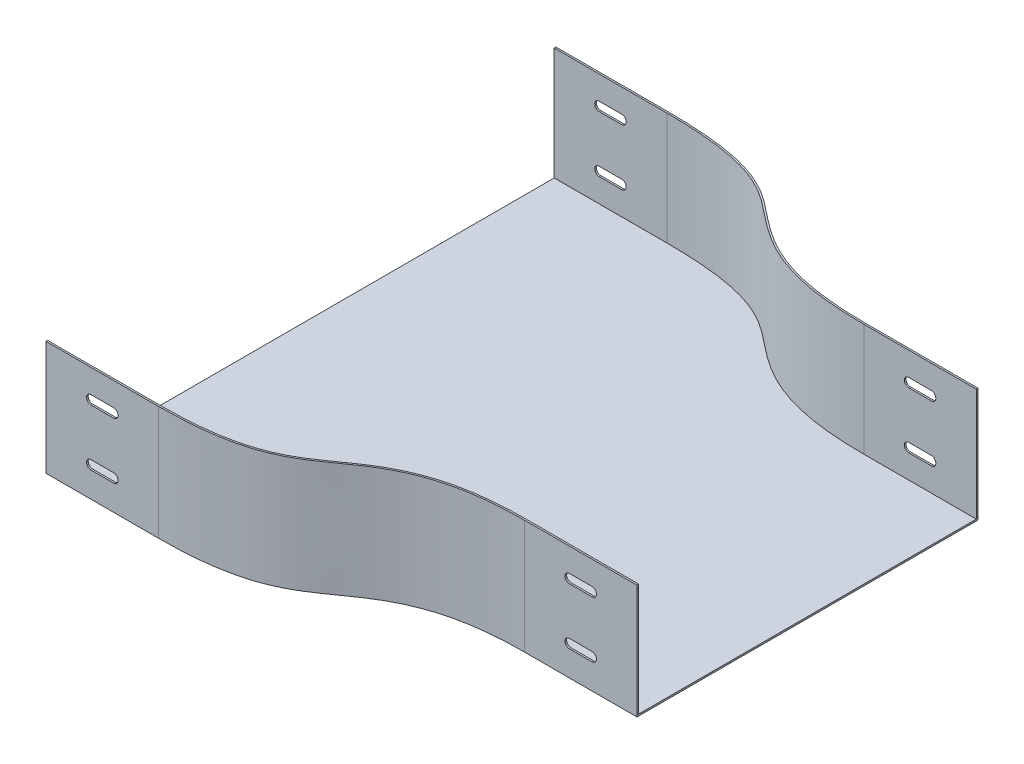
ISO-10303-21;
HEADER;
FILE_DESCRIPTION(('STEP AP214'),'2;1');
FILE_NAME('part.step','',(''),(''),'','','');
FILE_SCHEMA(('AUTOMOTIVE_DESIGN { 1 0 10303 214 1 1 1 1 }'));
ENDSEC;
DATA;
#1=APPLICATION_CONTEXT('core data for automotive mechanical design processes');
#2=APPLICATION_PROTOCOL_DEFINITION('international standard','automotive_design',2000,#1);
#3=PRODUCT_CONTEXT('',#1,'mechanical');
#4=PRODUCT('Part','Part','',(#3));
#5=PRODUCT_RELATED_PRODUCT_CATEGORY('part','',(#4));
#6=PRODUCT_DEFINITION_FORMATION('','',#4);
#7=PRODUCT_DEFINITION_CONTEXT('part definition',#1,'design');
#8=PRODUCT_DEFINITION('design','',#6,#7);
#9=PRODUCT_DEFINITION_SHAPE('','',#8);
#10=(LENGTH_UNIT() NAMED_UNIT(*) SI_UNIT(.MILLI.,.METRE.));
#11=(NAMED_UNIT(*) PLANE_ANGLE_UNIT() SI_UNIT($,.RADIAN.));
#12=(NAMED_UNIT(*) SI_UNIT($,.STERADIAN.) SOLID_ANGLE_UNIT());
#13=UNCERTAINTY_MEASURE_WITH_UNIT(LENGTH_MEASURE(1.E-05),#10,'distance_accuracy_value','');
#14=(GEOMETRIC_REPRESENTATION_CONTEXT(3) GLOBAL_UNCERTAINTY_ASSIGNED_CONTEXT((#13)) GLOBAL_UNIT_ASSIGNED_CONTEXT((#10,
#11,#12)) REPRESENTATION_CONTEXT('',''));
#15=CARTESIAN_POINT('',(0.,0.,0.));
#16=DIRECTION('',(0.,0.,1.));
#17=DIRECTION('',(1.,0.,0.));
#18=AXIS2_PLACEMENT_3D('',#15,#16,#17);
#19=CARTESIAN_POINT('',(225.,-1.5,-150.));
#20=DIRECTION('',(1.,0.,0.));
#21=DIRECTION('',(0.,0.,-1.));
#22=AXIS2_PLACEMENT_3D('',#19,#20,#21);
#23=PLANE('',#22);
#24=DIRECTION('',(0.,0.,-1.));
#25=VECTOR('',#24,1.);
#26=CARTESIAN_POINT('',(225.,0.,-150.));
#27=LINE('',#26,#25);
#28=CARTESIAN_POINT('',(225.,0.,150.));
#29=VERTEX_POINT('',#28);
#30=CARTESIAN_POINT('',(225.,0.,-150.));
#31=VERTEX_POINT('',#30);
#32=EDGE_CURVE('E689',#29,#31,#27,.T.);
#33=ORIENTED_EDGE('',*,*,#32,.F.);
#34=DIRECTION('',(0.,1.,0.));
#35=VECTOR('',#34,1.);
#36=CARTESIAN_POINT('',(225.,-457.956186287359,150.));
#37=LINE('',#36,#35);
#38=CARTESIAN_POINT('',(225.,100.,150.));
#39=VERTEX_POINT('',#38);
#40=EDGE_CURVE('E629',#29,#39,#37,.T.);
#41=ORIENTED_EDGE('',*,*,#40,.T.);
#42=DIRECTION('',(0.,0.,1.));
#43=VECTOR('',#42,1.);
#44=CARTESIAN_POINT('',(225.,100.,150.));
#45=LINE('',#44,#43);
#46=CARTESIAN_POINT('',(225.,100.,151.5));
#47=VERTEX_POINT('',#46);
#48=EDGE_CURVE('E793',#39,#47,#45,.T.);
#49=ORIENTED_EDGE('',*,*,#48,.T.);
#50=DIRECTION('',(0.,1.,0.));
#51=VECTOR('',#50,1.);
#52=CARTESIAN_POINT('',(225.,-457.956186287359,151.5));
#53=LINE('',#52,#51);
#54=CARTESIAN_POINT('',(225.,-1.5,151.5));
#55=VERTEX_POINT('',#54);
#56=EDGE_CURVE('E615',#55,#47,#53,.T.);
#57=ORIENTED_EDGE('',*,*,#56,.F.);
#58=DIRECTION('',(0.,0.,-1.));
#59=VECTOR('',#58,1.);
#60=CARTESIAN_POINT('',(225.,-1.5,-150.));
#61=LINE('',#60,#59);
#62=CARTESIAN_POINT('',(225.,-1.5,-151.5));
#63=VERTEX_POINT('',#62);
#64=EDGE_CURVE('E698',#55,#63,#61,.T.);
#65=ORIENTED_EDGE('',*,*,#64,.T.);
#66=DIRECTION('',(0.,-1.,0.));
#67=VECTOR('',#66,1.);
#68=CARTESIAN_POINT('',(225.,100.,-151.5));
#69=LINE('',#68,#67);
#70=CARTESIAN_POINT('',(225.,100.,-151.5));
#71=VERTEX_POINT('',#70);
#72=EDGE_CURVE('E769',#71,#63,#69,.T.);
#73=ORIENTED_EDGE('',*,*,#72,.F.);
#74=DIRECTION('',(0.,0.,1.));
#75=VECTOR('',#74,1.);
#76=CARTESIAN_POINT('',(225.,100.,-151.5));
#77=LINE('',#76,#75);
#78=CARTESIAN_POINT('',(225.,100.,-150.));
#79=VERTEX_POINT('',#78);
#80=EDGE_CURVE('E849',#71,#79,#77,.T.);
#81=ORIENTED_EDGE('',*,*,#80,.T.);
#82=DIRECTION('',(0.,-1.,0.));
#83=VECTOR('',#82,1.);
#84=CARTESIAN_POINT('',(225.,100.,-150.));
#85=LINE('',#84,#83);
#86=EDGE_CURVE('E772',#79,#31,#85,.T.);
#87=ORIENTED_EDGE('',*,*,#86,.T.);
#88=EDGE_LOOP('',(#33,#41,#49,#57,#65,#73,#81,#87));
#89=FACE_BOUND('',#88,.T.);
#90=ADVANCED_FACE('F32',(#89),#23,.T.);
#91=CARTESIAN_POINT('',(-225.,-1.5,-225.));
#92=DIRECTION('',(-1.,0.,0.));
#93=DIRECTION('',(0.,0.,1.));
#94=AXIS2_PLACEMENT_3D('',#91,#92,#93);
#95=PLANE('',#94);
#96=DIRECTION('',(0.,0.,1.));
#97=VECTOR('',#96,1.);
#98=CARTESIAN_POINT('',(-225.,0.,-225.));
#99=LINE('',#98,#97);
#100=CARTESIAN_POINT('',(-225.,0.,-225.));
#101=VERTEX_POINT('',#100);
#102=CARTESIAN_POINT('',(-225.,0.,225.));
#103=VERTEX_POINT('',#102);
#104=EDGE_CURVE('E673',#101,#103,#99,.T.);
#105=ORIENTED_EDGE('',*,*,#104,.F.);
#106=DIRECTION('',(0.,-1.,0.));
#107=VECTOR('',#106,1.);
#108=CARTESIAN_POINT('',(-225.,100.,-225.));
#109=LINE('',#108,#107);
#110=CARTESIAN_POINT('',(-225.,100.,-225.));
#111=VERTEX_POINT('',#110);
#112=EDGE_CURVE('E790',#111,#101,#109,.T.);
#113=ORIENTED_EDGE('',*,*,#112,.F.);
#114=DIRECTION('',(0.,0.,-1.));
#115=VECTOR('',#114,1.);
#116=CARTESIAN_POINT('',(-225.,100.,-225.));
#117=LINE('',#116,#115);
#118=CARTESIAN_POINT('',(-225.,100.,-226.5));
#119=VERTEX_POINT('',#118);
#120=EDGE_CURVE('E549',#111,#119,#117,.T.);
#121=ORIENTED_EDGE('',*,*,#120,.T.);
#122=DIRECTION('',(0.,-1.,0.));
#123=VECTOR('',#122,1.);
#124=CARTESIAN_POINT('',(-225.,100.,-226.5));
#125=LINE('',#124,#123);
#126=CARTESIAN_POINT('',(-225.,-1.5,-226.5));
#127=VERTEX_POINT('',#126);
#128=EDGE_CURVE('E787',#119,#127,#125,.T.);
#129=ORIENTED_EDGE('',*,*,#128,.T.);
#130=DIRECTION('',(0.,0.,1.));
#131=VECTOR('',#130,1.);
#132=CARTESIAN_POINT('',(-225.,-1.5,-225.));
#133=LINE('',#132,#131);
#134=CARTESIAN_POINT('',(-225.,-1.5,226.5));
#135=VERTEX_POINT('',#134);
#136=EDGE_CURVE('E688',#127,#135,#133,.T.);
#137=ORIENTED_EDGE('',*,*,#136,.T.);
#138=DIRECTION('',(0.,1.,0.));
#139=VECTOR('',#138,1.);
#140=CARTESIAN_POINT('',(-225.,-457.956186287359,226.5));
#141=LINE('',#140,#139);
#142=CARTESIAN_POINT('',(-225.,100.,226.5));
#143=VERTEX_POINT('',#142);
#144=EDGE_CURVE('E618',#135,#143,#141,.T.);
#145=ORIENTED_EDGE('',*,*,#144,.T.);
#146=DIRECTION('',(0.,0.,-1.));
#147=VECTOR('',#146,1.);
#148=CARTESIAN_POINT('',(-225.,100.,226.5));
#149=LINE('',#148,#147);
#150=CARTESIAN_POINT('',(-225.,100.,225.));
#151=VERTEX_POINT('',#150);
#152=EDGE_CURVE('E645',#143,#151,#149,.T.);
#153=ORIENTED_EDGE('',*,*,#152,.T.);
#154=DIRECTION('',(0.,1.,0.));
#155=VECTOR('',#154,1.);
#156=CARTESIAN_POINT('',(-225.,-457.956186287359,225.));
#157=LINE('',#156,#155);
#158=EDGE_CURVE('E622',#103,#151,#157,.T.);
#159=ORIENTED_EDGE('',*,*,#158,.F.);
#160=EDGE_LOOP('',(#105,#113,#121,#129,#137,#145,#153,#159));
#161=FACE_BOUND('',#160,.T.);
#162=ADVANCED_FACE('F34',(#161),#95,.T.);
#163=CARTESIAN_POINT('',(2.56621988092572,-1.5,-185.494730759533));
#164=DIRECTION('',(0.,1.,0.));
#165=DIRECTION('',(0.,0.,1.));
#166=AXIS2_PLACEMENT_3D('',#163,#164,#165);
#167=PLANE('',#166);
#168=ORIENTED_EDGE('',*,*,#136,.F.);
#169=DIRECTION('',(1.,0.,0.));
#170=VECTOR('',#169,1.);
#171=CARTESIAN_POINT('',(-125.,-1.5,-226.5));
#172=LINE('',#171,#170);
#173=CARTESIAN_POINT('',(-125.,-1.5,-226.5));
#174=VERTEX_POINT('',#173);
#175=EDGE_CURVE('E541',#127,#174,#172,.T.);
#176=ORIENTED_EDGE('',*,*,#175,.T.);
#177=CARTESIAN_POINT('',(125.,-1.5,-151.5));
#178=CARTESIAN_POINT('',(107.988272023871,-1.5,-151.5));
#179=CARTESIAN_POINT('',(93.3831829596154,-1.5,-152.547061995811));
#180=CARTESIAN_POINT('',(67.9679694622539,-1.5,-156.258885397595));
#181=CARTESIAN_POINT('',(57.1582214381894,-1.5,-158.92299592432));
#182=CARTESIAN_POINT('',(38.2966395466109,-1.5,-165.396812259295));
#183=CARTESIAN_POINT('',(30.2438650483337,-1.5,-169.206086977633));
#184=CARTESIAN_POINT('',(15.8437266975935,-1.5,-177.524967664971));
#185=CARTESIAN_POINT('',(9.49573524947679,-1.5,-182.035959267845));
#186=CARTESIAN_POINT('',(1.98027369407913,-1.5,-187.843107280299));
#187=CARTESIAN_POINT('',(0.49987905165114,-1.5,-189.012701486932));
#188=CARTESIAN_POINT('',(-2.44511416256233,-1.5,-191.363763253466));
#189=CARTESIAN_POINT('',(-3.91095875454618,-1.5,-192.544771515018));
#190=CARTESIAN_POINT('',(-8.34491484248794,-1.5,-196.087419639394));
#191=CARTESIAN_POINT('',(-11.3495989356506,-1.5,-198.448973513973));
#192=CARTESIAN_POINT('',(-20.9565153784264,-1.5,-205.386496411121));
#193=CARTESIAN_POINT('',(-28.1539803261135,-1.5,-209.812223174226));
#194=CARTESIAN_POINT('',(-46.4517492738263,-1.5,-217.455812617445));
#195=CARTESIAN_POINT('',(-57.5464530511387,-1.5,-220.67423635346));
#196=CARTESIAN_POINT('',(-85.9813722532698,-1.5,-225.195053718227));
#197=CARTESIAN_POINT('',(-103.324243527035,-1.5,-226.5));
#198=CARTESIAN_POINT('',(-125.,-1.5,-226.5));
#199=B_SPLINE_CURVE_WITH_KNOTS('',3,(#177,#178,#179,#180,#181,#182,#183,#184,#185,#186,#187,
#188,#189,#190,#191,#192,#193,#194,#195,#196,#197,#198),.UNSPECIFIED.,.F.,.F.,(4,2,2,2,2,2,2,2,
2,2,4),(0.,0.125,0.25,0.375,0.500000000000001,0.53125,0.5625,0.625,0.75,0.875,1.),.UNSPECIFIED.);
#200=CARTESIAN_POINT('',(125.,-1.5,-151.5));
#201=VERTEX_POINT('',#200);
#202=EDGE_CURVE('E536',#174,#201,#199,.F.);
#203=ORIENTED_EDGE('',*,*,#202,.T.);
#204=DIRECTION('',(1.,0.,0.));
#205=VECTOR('',#204,1.);
#206=CARTESIAN_POINT('',(225.,-1.5,-151.5));
#207=LINE('',#206,#205);
#208=EDGE_CURVE('E533',#201,#63,#207,.T.);
#209=ORIENTED_EDGE('',*,*,#208,.T.);
#210=ORIENTED_EDGE('',*,*,#64,.F.);
#211=DIRECTION('',(-1.,0.,0.));
#212=VECTOR('',#211,1.);
#213=CARTESIAN_POINT('',(125.,-1.5,151.5));
#214=LINE('',#213,#212);
#215=CARTESIAN_POINT('',(125.,-1.5,151.5));
#216=VERTEX_POINT('',#215);
#217=EDGE_CURVE('E659',#55,#216,#214,.T.);
#218=ORIENTED_EDGE('',*,*,#217,.T.);
#219=CARTESIAN_POINT('',(-125.,-1.5,226.5));
#220=CARTESIAN_POINT('',(-105.948506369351,-1.5,226.5));
#221=CARTESIAN_POINT('',(-90.2184163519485,-1.5,225.32463468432));
#222=CARTESIAN_POINT('',(-63.6105121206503,-1.5,221.194553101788));
#223=CARTESIAN_POINT('',(-52.7316222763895,-1.5,218.238147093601));
#224=CARTESIAN_POINT('',(-34.0761500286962,-1.5,211.127632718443));
#225=CARTESIAN_POINT('',(-26.3027069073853,-1.5,206.973765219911));
#226=CARTESIAN_POINT('',(-12.1315264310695,-1.5,198.108635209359));
#227=CARTESIAN_POINT('',(-5.73384393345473,-1.5,193.40138536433));
#228=CARTESIAN_POINT('',(7.46832371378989,-1.5,184.0463850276));
#229=CARTESIAN_POINT('',(14.2844548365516,-1.5,179.38861232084));
#230=CARTESIAN_POINT('',(29.4208271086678,-1.5,170.672069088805));
#231=CARTESIAN_POINT('',(37.7411126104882,-1.5,166.611949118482));
#232=CARTESIAN_POINT('',(56.9775901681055,-1.5,159.646315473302));
#233=CARTESIAN_POINT('',(67.8948666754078,-1.5,156.740668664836));
#234=CARTESIAN_POINT('',(93.4157523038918,-1.5,152.667143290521));
#235=CARTESIAN_POINT('',(108.019300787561,-1.5,151.5));
#236=CARTESIAN_POINT('',(125.,-1.5,151.5));
#237=B_SPLINE_CURVE_WITH_KNOTS('',3,(#219,#220,#221,#222,#223,#224,#225,#226,#227,#228,#229,
#230,#231,#232,#233,#234,#235,#236),.UNSPECIFIED.,.F.,.F.,(4,2,2,2,2,2,2,2,4),(0.,0.125,0.25,
0.375,0.5,0.625,0.75,0.875,1.),.UNSPECIFIED.);
#238=CARTESIAN_POINT('',(-125.,-1.5,226.5));
#239=VERTEX_POINT('',#238);
#240=EDGE_CURVE('E656',#216,#239,#237,.F.);
#241=ORIENTED_EDGE('',*,*,#240,.T.);
#242=DIRECTION('',(-1.,0.,0.));
#243=VECTOR('',#242,1.);
#244=CARTESIAN_POINT('',(-225.,-1.5,226.5));
#245=LINE('',#244,#243);
#246=EDGE_CURVE('E613',#239,#135,#245,.T.);
#247=ORIENTED_EDGE('',*,*,#246,.T.);
#248=EDGE_LOOP('',(#168,#176,#203,#209,#210,#218,#241,#247));
#249=FACE_BOUND('',#248,.T.);
#250=ADVANCED_FACE('F762',(#249),#167,.F.);
#251=CARTESIAN_POINT('',(2.56621988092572,0.,-185.494730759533));
#252=DIRECTION('',(0.,1.,0.));
#253=DIRECTION('',(0.,0.,1.));
#254=AXIS2_PLACEMENT_3D('',#251,#252,#253);
#255=PLANE('',#254);
#256=CARTESIAN_POINT('',(125.,0.,-150.));
#257=CARTESIAN_POINT('',(54.2715030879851,0.,-150.));
#258=CARTESIAN_POINT('',(-2.9172173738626,0.,-184.82199861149));
#259=CARTESIAN_POINT('',(-41.6212592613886,0.,-225.));
#260=CARTESIAN_POINT('',(-125.,0.,-225.));
#261=B_SPLINE_CURVE_WITH_KNOTS('',3,(#256,#257,#258,#259,#260),.UNSPECIFIED.,.F.,.F.,(4,1,4),
(0.,0.517830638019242,1.),.UNSPECIFIED.);
#262=CARTESIAN_POINT('',(125.,0.,-150.));
#263=VERTEX_POINT('',#262);
#264=CARTESIAN_POINT('',(-125.,0.,-225.));
#265=VERTEX_POINT('',#264);
#266=EDGE_CURVE('E663',#263,#265,#261,.T.);
#267=ORIENTED_EDGE('',*,*,#266,.T.);
#268=DIRECTION('',(-1.,0.,0.));
#269=VECTOR('',#268,1.);
#270=CARTESIAN_POINT('',(-225.,0.,-225.));
#271=LINE('',#270,#269);
#272=EDGE_CURVE('E667',#265,#101,#271,.T.);
#273=ORIENTED_EDGE('',*,*,#272,.T.);
#274=ORIENTED_EDGE('',*,*,#104,.T.);
#275=DIRECTION('',(1.,0.,0.));
#276=VECTOR('',#275,1.);
#277=CARTESIAN_POINT('',(-225.,0.,225.));
#278=LINE('',#277,#276);
#279=CARTESIAN_POINT('',(-125.,0.,225.));
#280=VERTEX_POINT('',#279);
#281=EDGE_CURVE('E823',#103,#280,#278,.T.);
#282=ORIENTED_EDGE('',*,*,#281,.T.);
#283=CARTESIAN_POINT('',(-125.,0.,225.));
#284=CARTESIAN_POINT('',(-49.0408687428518,0.,225.));
#285=CARTESIAN_POINT('',(-3.88069929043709,0.,187.5));
#286=CARTESIAN_POINT('',(56.8022673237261,0.,150.));
#287=CARTESIAN_POINT('',(125.,0.,150.));
#288=B_SPLINE_CURVE_WITH_KNOTS('',3,(#283,#284,#285,#286,#287),.UNSPECIFIED.,.F.,.F.,(4,1,4),
(0.,0.5,1.),.UNSPECIFIED.);
#289=CARTESIAN_POINT('',(125.,0.,150.));
#290=VERTEX_POINT('',#289);
#291=EDGE_CURVE('E825',#280,#290,#288,.T.);
#292=ORIENTED_EDGE('',*,*,#291,.T.);
#293=DIRECTION('',(1.,0.,0.));
#294=VECTOR('',#293,1.);
#295=CARTESIAN_POINT('',(225.,0.,150.));
#296=LINE('',#295,#294);
#297=EDGE_CURVE('E827',#290,#29,#296,.T.);
#298=ORIENTED_EDGE('',*,*,#297,.T.);
#299=ORIENTED_EDGE('',*,*,#32,.T.);
#300=DIRECTION('',(-1.,0.,0.));
#301=VECTOR('',#300,1.);
#302=CARTESIAN_POINT('',(225.,0.,-150.));
#303=LINE('',#302,#301);
#304=EDGE_CURVE('E683',#31,#263,#303,.T.);
#305=ORIENTED_EDGE('',*,*,#304,.T.);
#306=EDGE_LOOP('',(#267,#273,#274,#282,#292,#298,#299,#305));
#307=FACE_BOUND('',#306,.T.);
#308=ADVANCED_FACE('F877',(#307),#255,.T.);
#309=CARTESIAN_POINT('',(125.,-457.956186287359,150.));
#310=DIRECTION('',(0.,0.,1.));
#311=DIRECTION('',(1.,0.,0.));
#312=AXIS2_PLACEMENT_3D('',#309,#310,#311);
#313=PLANE('',#312);
#314=DIRECTION('',(-1.,0.,0.));
#315=VECTOR('',#314,1.);
#316=CARTESIAN_POINT('',(125.,29.,150.));
#317=LINE('',#316,#315);
#318=CARTESIAN_POINT('',(185.,29.,150.));
#319=VERTEX_POINT('',#318);
#320=CARTESIAN_POINT('',(165.,29.,150.));
#321=VERTEX_POINT('',#320);
#322=EDGE_CURVE('E476',#319,#321,#317,.T.);
#323=ORIENTED_EDGE('',*,*,#322,.T.);
#324=CARTESIAN_POINT('',(165.,25.,150.));
#325=DIRECTION('',(0.,0.,1.));
#326=DIRECTION('',(1.,0.,0.));
#327=AXIS2_PLACEMENT_3D('',#324,#325,#326);
#328=CIRCLE('',#327,4.);
#329=CARTESIAN_POINT('',(165.,21.,150.));
#330=VERTEX_POINT('',#329);
#331=EDGE_CURVE('E485',#321,#330,#328,.T.);
#332=ORIENTED_EDGE('',*,*,#331,.T.);
#333=DIRECTION('',(1.,0.,0.));
#334=VECTOR('',#333,1.);
#335=CARTESIAN_POINT('',(125.,21.,150.));
#336=LINE('',#335,#334);
#337=CARTESIAN_POINT('',(185.,21.,150.));
#338=VERTEX_POINT('',#337);
#339=EDGE_CURVE('E462',#330,#338,#336,.T.);
#340=ORIENTED_EDGE('',*,*,#339,.T.);
#341=CARTESIAN_POINT('',(185.,25.,150.));
#342=DIRECTION('',(0.,0.,1.));
#343=DIRECTION('',(1.,0.,0.));
#344=AXIS2_PLACEMENT_3D('',#341,#342,#343);
#345=CIRCLE('',#344,4.);
#346=EDGE_CURVE('E469',#338,#319,#345,.T.);
#347=ORIENTED_EDGE('',*,*,#346,.T.);
#348=EDGE_LOOP('',(#323,#332,#340,#347));
#349=FACE_BOUND('',#348,.T.);
#350=DIRECTION('',(-1.,0.,0.));
#351=VECTOR('',#350,1.);
#352=CARTESIAN_POINT('',(125.,79.,150.));
#353=LINE('',#352,#351);
#354=CARTESIAN_POINT('',(185.,79.,150.));
#355=VERTEX_POINT('',#354);
#356=CARTESIAN_POINT('',(165.,79.,150.));
#357=VERTEX_POINT('',#356);
#358=EDGE_CURVE('E521',#355,#357,#353,.T.);
#359=ORIENTED_EDGE('',*,*,#358,.T.);
#360=CARTESIAN_POINT('',(165.,75.,150.));
#361=DIRECTION('',(0.,0.,1.));
#362=DIRECTION('',(1.,0.,0.));
#363=AXIS2_PLACEMENT_3D('',#360,#361,#362);
#364=CIRCLE('',#363,4.);
#365=CARTESIAN_POINT('',(165.,71.,150.));
#366=VERTEX_POINT('',#365);
#367=EDGE_CURVE('E530',#357,#366,#364,.T.);
#368=ORIENTED_EDGE('',*,*,#367,.T.);
#369=DIRECTION('',(1.,0.,0.));
#370=VECTOR('',#369,1.);
#371=CARTESIAN_POINT('',(125.,71.,150.));
#372=LINE('',#371,#370);
#373=CARTESIAN_POINT('',(185.,71.,150.));
#374=VERTEX_POINT('',#373);
#375=EDGE_CURVE('E507',#366,#374,#372,.T.);
#376=ORIENTED_EDGE('',*,*,#375,.T.);
#377=CARTESIAN_POINT('',(185.,75.,150.));
#378=DIRECTION('',(0.,0.,1.));
#379=DIRECTION('',(1.,0.,0.));
#380=AXIS2_PLACEMENT_3D('',#377,#378,#379);
#381=CIRCLE('',#380,4.);
#382=EDGE_CURVE('E514',#374,#355,#381,.T.);
#383=ORIENTED_EDGE('',*,*,#382,.T.);
#384=EDGE_LOOP('',(#359,#368,#376,#383));
#385=FACE_BOUND('',#384,.T.);
#386=ORIENTED_EDGE('',*,*,#297,.F.);
#387=DIRECTION('',(0.,1.,0.));
#388=VECTOR('',#387,1.);
#389=CARTESIAN_POINT('',(125.,-457.956186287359,150.));
#390=LINE('',#389,#388);
#391=CARTESIAN_POINT('',(125.,100.,150.));
#392=VERTEX_POINT('',#391);
#393=EDGE_CURVE('E623',#290,#392,#390,.T.);
#394=ORIENTED_EDGE('',*,*,#393,.T.);
#395=DIRECTION('',(1.,0.,0.));
#396=VECTOR('',#395,1.);
#397=CARTESIAN_POINT('',(125.,100.,150.));
#398=LINE('',#397,#396);
#399=EDGE_CURVE('E795',#392,#39,#398,.T.);
#400=ORIENTED_EDGE('',*,*,#399,.T.);
#401=ORIENTED_EDGE('',*,*,#40,.F.);
#402=EDGE_LOOP('',(#386,#394,#400,#401));
#403=FACE_BOUND('',#402,.T.);
#404=ADVANCED_FACE('F880',(#349,#385,#403),#313,.F.);
#405=CARTESIAN_POINT('',(-125.,-457.956186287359,225.));
#406=CARTESIAN_POINT('',(-49.0408687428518,-457.956186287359,225.));
#407=CARTESIAN_POINT('',(-3.88069929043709,-457.956186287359,187.5));
#408=CARTESIAN_POINT('',(56.8022673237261,-457.956186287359,150.));
#409=CARTESIAN_POINT('',(125.,-457.956186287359,150.));
#410=B_SPLINE_CURVE_WITH_KNOTS('',3,(#405,#406,#407,#408,#409),.UNSPECIFIED.,.F.,.F.,(4,1,4),
(0.,0.5,1.),.UNSPECIFIED.);
#411=DIRECTION('',(0.,1.,0.));
#412=VECTOR('',#411,1.);
#413=SURFACE_OF_LINEAR_EXTRUSION('',#410,#412);
#414=ORIENTED_EDGE('',*,*,#291,.F.);
#415=DIRECTION('',(0.,1.,0.));
#416=VECTOR('',#415,1.);
#417=CARTESIAN_POINT('',(-125.,-457.956186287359,225.));
#418=LINE('',#417,#416);
#419=CARTESIAN_POINT('',(-125.,100.,225.));
#420=VERTEX_POINT('',#419);
#421=EDGE_CURVE('E619',#280,#420,#418,.T.);
#422=ORIENTED_EDGE('',*,*,#421,.T.);
#423=CARTESIAN_POINT('',(-125.,100.,225.));
#424=CARTESIAN_POINT('',(-49.0408687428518,100.,225.));
#425=CARTESIAN_POINT('',(-3.88069929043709,100.,187.5));
#426=CARTESIAN_POINT('',(56.8022673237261,100.,150.));
#427=CARTESIAN_POINT('',(125.,100.,150.));
#428=B_SPLINE_CURVE_WITH_KNOTS('',3,(#423,#424,#425,#426,#427),.UNSPECIFIED.,.F.,.F.,(4,1,4),
(0.,0.5,1.),.UNSPECIFIED.);
#429=EDGE_CURVE('E798',#420,#392,#428,.T.);
#430=ORIENTED_EDGE('',*,*,#429,.T.);
#431=ORIENTED_EDGE('',*,*,#393,.F.);
#432=EDGE_LOOP('',(#414,#422,#430,#431));
#433=FACE_BOUND('',#432,.T.);
#434=ADVANCED_FACE('F888',(#433),#413,.F.);
#435=CARTESIAN_POINT('',(-225.,-457.956186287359,225.));
#436=DIRECTION('',(0.,0.,1.));
#437=DIRECTION('',(1.,0.,0.));
#438=AXIS2_PLACEMENT_3D('',#435,#436,#437);
#439=PLANE('',#438);
#440=DIRECTION('',(-1.,0.,0.));
#441=VECTOR('',#440,1.);
#442=CARTESIAN_POINT('',(-225.,29.,225.));
#443=LINE('',#442,#441);
#444=CARTESIAN_POINT('',(-165.,29.,225.));
#445=VERTEX_POINT('',#444);
#446=CARTESIAN_POINT('',(-185.,29.,225.));
#447=VERTEX_POINT('',#446);
#448=EDGE_CURVE('E387',#445,#447,#443,.T.);
#449=ORIENTED_EDGE('',*,*,#448,.T.);
#450=CARTESIAN_POINT('',(-185.,25.,225.));
#451=DIRECTION('',(0.,0.,1.));
#452=DIRECTION('',(1.,0.,0.));
#453=AXIS2_PLACEMENT_3D('',#450,#451,#452);
#454=CIRCLE('',#453,4.);
#455=CARTESIAN_POINT('',(-185.,21.,225.));
#456=VERTEX_POINT('',#455);
#457=EDGE_CURVE('E390',#447,#456,#454,.T.);
#458=ORIENTED_EDGE('',*,*,#457,.T.);
#459=DIRECTION('',(1.,0.,0.));
#460=VECTOR('',#459,1.);
#461=CARTESIAN_POINT('',(-225.,21.,225.));
#462=LINE('',#461,#460);
#463=CARTESIAN_POINT('',(-165.,21.,225.));
#464=VERTEX_POINT('',#463);
#465=EDGE_CURVE('E377',#456,#464,#462,.T.);
#466=ORIENTED_EDGE('',*,*,#465,.T.);
#467=CARTESIAN_POINT('',(-165.,25.,225.));
#468=DIRECTION('',(0.,0.,1.));
#469=DIRECTION('',(1.,0.,0.));
#470=AXIS2_PLACEMENT_3D('',#467,#468,#469);
#471=CIRCLE('',#470,4.);
#472=EDGE_CURVE('E343',#464,#445,#471,.T.);
#473=ORIENTED_EDGE('',*,*,#472,.T.);
#474=EDGE_LOOP('',(#449,#458,#466,#473));
#475=FACE_BOUND('',#474,.T.);
#476=DIRECTION('',(-1.,0.,0.));
#477=VECTOR('',#476,1.);
#478=CARTESIAN_POINT('',(-225.,79.,225.));
#479=LINE('',#478,#477);
#480=CARTESIAN_POINT('',(-165.,79.,225.));
#481=VERTEX_POINT('',#480);
#482=CARTESIAN_POINT('',(-185.,79.,225.));
#483=VERTEX_POINT('',#482);
#484=EDGE_CURVE('E437',#481,#483,#479,.T.);
#485=ORIENTED_EDGE('',*,*,#484,.T.);
#486=CARTESIAN_POINT('',(-185.,75.,225.));
#487=DIRECTION('',(0.,0.,1.));
#488=DIRECTION('',(1.,0.,0.));
#489=AXIS2_PLACEMENT_3D('',#486,#487,#488);
#490=CIRCLE('',#489,4.);
#491=CARTESIAN_POINT('',(-185.,71.,225.));
#492=VERTEX_POINT('',#491);
#493=EDGE_CURVE('E440',#483,#492,#490,.T.);
#494=ORIENTED_EDGE('',*,*,#493,.T.);
#495=DIRECTION('',(1.,0.,0.));
#496=VECTOR('',#495,1.);
#497=CARTESIAN_POINT('',(-225.,71.,225.));
#498=LINE('',#497,#496);
#499=CARTESIAN_POINT('',(-165.,71.,225.));
#500=VERTEX_POINT('',#499);
#501=EDGE_CURVE('E420',#492,#500,#498,.T.);
#502=ORIENTED_EDGE('',*,*,#501,.T.);
#503=CARTESIAN_POINT('',(-165.,75.,225.));
#504=DIRECTION('',(0.,0.,1.));
#505=DIRECTION('',(1.,0.,0.));
#506=AXIS2_PLACEMENT_3D('',#503,#504,#505);
#507=CIRCLE('',#506,4.);
#508=EDGE_CURVE('E434',#500,#481,#507,.T.);
#509=ORIENTED_EDGE('',*,*,#508,.T.);
#510=EDGE_LOOP('',(#485,#494,#502,#509));
#511=FACE_BOUND('',#510,.T.);
#512=ORIENTED_EDGE('',*,*,#281,.F.);
#513=ORIENTED_EDGE('',*,*,#158,.T.);
#514=DIRECTION('',(1.,0.,0.));
#515=VECTOR('',#514,1.);
#516=CARTESIAN_POINT('',(-225.,100.,225.));
#517=LINE('',#516,#515);
#518=EDGE_CURVE('E803',#151,#420,#517,.T.);
#519=ORIENTED_EDGE('',*,*,#518,.T.);
#520=ORIENTED_EDGE('',*,*,#421,.F.);
#521=EDGE_LOOP('',(#512,#513,#519,#520));
#522=FACE_BOUND('',#521,.T.);
#523=ADVANCED_FACE('F820',(#475,#511,#522),#439,.F.);
#524=CARTESIAN_POINT('',(-225.,-457.956186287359,226.5));
#525=DIRECTION('',(0.,0.,1.));
#526=DIRECTION('',(1.,0.,0.));
#527=AXIS2_PLACEMENT_3D('',#524,#525,#526);
#528=PLANE('',#527);
#529=CARTESIAN_POINT('',(-185.,25.,226.5));
#530=DIRECTION('',(0.,0.,1.));
#531=DIRECTION('',(1.,0.,0.));
#532=AXIS2_PLACEMENT_3D('',#529,#530,#531);
#533=CIRCLE('',#532,4.);
#534=CARTESIAN_POINT('',(-185.,29.,226.5));
#535=VERTEX_POINT('',#534);
#536=CARTESIAN_POINT('',(-185.,21.,226.5));
#537=VERTEX_POINT('',#536);
#538=EDGE_CURVE('E55',#535,#537,#533,.T.);
#539=ORIENTED_EDGE('',*,*,#538,.F.);
#540=DIRECTION('',(-1.,0.,0.));
#541=VECTOR('',#540,1.);
#542=CARTESIAN_POINT('',(-185.,29.,226.5));
#543=LINE('',#542,#541);
#544=CARTESIAN_POINT('',(-165.,29.,226.5));
#545=VERTEX_POINT('',#544);
#546=EDGE_CURVE('E357',#545,#535,#543,.T.);
#547=ORIENTED_EDGE('',*,*,#546,.F.);
#548=CARTESIAN_POINT('',(-165.,25.,226.5));
#549=DIRECTION('',(0.,0.,1.));
#550=DIRECTION('',(1.,0.,0.));
#551=AXIS2_PLACEMENT_3D('',#548,#549,#550);
#552=CIRCLE('',#551,4.);
#553=CARTESIAN_POINT('',(-165.,21.,226.5));
#554=VERTEX_POINT('',#553);
#555=EDGE_CURVE('E340',#554,#545,#552,.T.);
#556=ORIENTED_EDGE('',*,*,#555,.F.);
#557=DIRECTION('',(1.,0.,0.));
#558=VECTOR('',#557,1.);
#559=CARTESIAN_POINT('',(-185.,21.,226.5));
#560=LINE('',#559,#558);
#561=EDGE_CURVE('E349',#537,#554,#560,.T.);
#562=ORIENTED_EDGE('',*,*,#561,.F.);
#563=EDGE_LOOP('',(#539,#547,#556,#562));
#564=FACE_BOUND('',#563,.T.);
#565=CARTESIAN_POINT('',(-185.,75.,226.5));
#566=DIRECTION('',(0.,0.,1.));
#567=DIRECTION('',(1.,0.,0.));
#568=AXIS2_PLACEMENT_3D('',#565,#566,#567);
#569=CIRCLE('',#568,4.);
#570=CARTESIAN_POINT('',(-185.,79.,226.5));
#571=VERTEX_POINT('',#570);
#572=CARTESIAN_POINT('',(-185.,71.,226.5));
#573=VERTEX_POINT('',#572);
#574=EDGE_CURVE('E393',#571,#573,#569,.T.);
#575=ORIENTED_EDGE('',*,*,#574,.F.);
#576=DIRECTION('',(-1.,0.,0.));
#577=VECTOR('',#576,1.);
#578=CARTESIAN_POINT('',(-185.,79.,226.5));
#579=LINE('',#578,#577);
#580=CARTESIAN_POINT('',(-165.,79.,226.5));
#581=VERTEX_POINT('',#580);
#582=EDGE_CURVE('E401',#581,#571,#579,.T.);
#583=ORIENTED_EDGE('',*,*,#582,.F.);
#584=CARTESIAN_POINT('',(-165.,75.,226.5));
#585=DIRECTION('',(0.,0.,1.));
#586=DIRECTION('',(1.,0.,0.));
#587=AXIS2_PLACEMENT_3D('',#584,#585,#586);
#588=CIRCLE('',#587,4.);
#589=CARTESIAN_POINT('',(-165.,71.,226.5));
#590=VERTEX_POINT('',#589);
#591=EDGE_CURVE('E398',#590,#581,#588,.T.);
#592=ORIENTED_EDGE('',*,*,#591,.F.);
#593=DIRECTION('',(1.,0.,0.));
#594=VECTOR('',#593,1.);
#595=CARTESIAN_POINT('',(-185.,71.,226.5));
#596=LINE('',#595,#594);
#597=EDGE_CURVE('E395',#573,#590,#596,.T.);
#598=ORIENTED_EDGE('',*,*,#597,.F.);
#599=EDGE_LOOP('',(#575,#583,#592,#598));
#600=FACE_BOUND('',#599,.T.);
#601=DIRECTION('',(0.,1.,0.));
#602=VECTOR('',#601,1.);
#603=CARTESIAN_POINT('',(-125.,-457.956186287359,226.5));
#604=LINE('',#603,#602);
#605=CARTESIAN_POINT('',(-125.,100.,226.5));
#606=VERTEX_POINT('',#605);
#607=EDGE_CURVE('E614',#239,#606,#604,.T.);
#608=ORIENTED_EDGE('',*,*,#607,.T.);
#609=DIRECTION('',(1.,0.,0.));
#610=VECTOR('',#609,1.);
#611=CARTESIAN_POINT('',(-225.,100.,226.5));
#612=LINE('',#611,#610);
#613=EDGE_CURVE('E641',#143,#606,#612,.T.);
#614=ORIENTED_EDGE('',*,*,#613,.F.);
#615=ORIENTED_EDGE('',*,*,#144,.F.);
#616=ORIENTED_EDGE('',*,*,#246,.F.);
#617=EDGE_LOOP('',(#608,#614,#615,#616));
#618=FACE_BOUND('',#617,.T.);
#619=ADVANCED_FACE('F354',(#564,#600,#618),#528,.T.);
#620=CARTESIAN_POINT('',(-125.,-457.956186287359,226.5));
#621=CARTESIAN_POINT('',(-105.948506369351,-457.956186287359,226.5));
#622=CARTESIAN_POINT('',(-90.2184163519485,-457.956186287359,225.32463468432));
#623=CARTESIAN_POINT('',(-63.6105121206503,-457.956186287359,221.194553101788));
#624=CARTESIAN_POINT('',(-52.7316222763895,-457.956186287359,218.238147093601));
#625=CARTESIAN_POINT('',(-34.0761500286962,-457.956186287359,211.127632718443));
#626=CARTESIAN_POINT('',(-26.3027069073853,-457.956186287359,206.973765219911));
#627=CARTESIAN_POINT('',(-12.1315264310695,-457.956186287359,198.108635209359));
#628=CARTESIAN_POINT('',(-5.73384393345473,-457.956186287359,193.40138536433));
#629=CARTESIAN_POINT('',(7.46832371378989,-457.956186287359,184.0463850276));
#630=CARTESIAN_POINT('',(14.2844548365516,-457.956186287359,179.38861232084));
#631=CARTESIAN_POINT('',(29.4208271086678,-457.956186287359,170.672069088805));
#632=CARTESIAN_POINT('',(37.7411126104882,-457.956186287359,166.611949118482));
#633=CARTESIAN_POINT('',(56.9775901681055,-457.956186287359,159.646315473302));
#634=CARTESIAN_POINT('',(67.8948666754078,-457.956186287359,156.740668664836));
#635=CARTESIAN_POINT('',(93.4157523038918,-457.956186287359,152.667143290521));
#636=CARTESIAN_POINT('',(108.019300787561,-457.956186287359,151.5));
#637=CARTESIAN_POINT('',(125.,-457.956186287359,151.5));
#638=B_SPLINE_CURVE_WITH_KNOTS('',3,(#620,#621,#622,#623,#624,#625,#626,#627,#628,#629,#630,
#631,#632,#633,#634,#635,#636,#637),.UNSPECIFIED.,.F.,.F.,(4,2,2,2,2,2,2,2,4),(0.,0.125,0.25,
0.375,0.5,0.625,0.75,0.875,1.),.UNSPECIFIED.);
#639=DIRECTION('',(0.,1.,0.));
#640=VECTOR('',#639,1.);
#641=SURFACE_OF_LINEAR_EXTRUSION('',#638,#640);
#642=DIRECTION('',(0.,1.,0.));
#643=VECTOR('',#642,1.);
#644=CARTESIAN_POINT('',(125.,-457.956186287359,151.5));
#645=LINE('',#644,#643);
#646=CARTESIAN_POINT('',(125.,100.,151.5));
#647=VERTEX_POINT('',#646);
#648=EDGE_CURVE('E610',#216,#647,#645,.T.);
#649=ORIENTED_EDGE('',*,*,#648,.T.);
#650=CARTESIAN_POINT('',(-125.,100.,226.5));
#651=CARTESIAN_POINT('',(-105.948506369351,100.,226.5));
#652=CARTESIAN_POINT('',(-90.2184163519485,100.,225.32463468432));
#653=CARTESIAN_POINT('',(-63.6105121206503,100.,221.194553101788));
#654=CARTESIAN_POINT('',(-52.7316222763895,100.,218.238147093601));
#655=CARTESIAN_POINT('',(-34.0761500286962,100.,211.127632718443));
#656=CARTESIAN_POINT('',(-26.3027069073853,100.,206.973765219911));
#657=CARTESIAN_POINT('',(-12.1315264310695,100.,198.108635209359));
#658=CARTESIAN_POINT('',(-5.73384393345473,100.,193.40138536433));
#659=CARTESIAN_POINT('',(7.46832371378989,100.,184.0463850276));
#660=CARTESIAN_POINT('',(14.2844548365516,100.,179.38861232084));
#661=CARTESIAN_POINT('',(29.4208271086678,100.,170.672069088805));
#662=CARTESIAN_POINT('',(37.7411126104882,100.,166.611949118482));
#663=CARTESIAN_POINT('',(56.9775901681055,100.,159.646315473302));
#664=CARTESIAN_POINT('',(67.8948666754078,100.,156.740668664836));
#665=CARTESIAN_POINT('',(93.4157523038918,100.,152.667143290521));
#666=CARTESIAN_POINT('',(108.019300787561,100.,151.5));
#667=CARTESIAN_POINT('',(125.,100.,151.5));
#668=B_SPLINE_CURVE_WITH_KNOTS('',3,(#650,#651,#652,#653,#654,#655,#656,#657,#658,#659,#660,
#661,#662,#663,#664,#665,#666,#667),.UNSPECIFIED.,.F.,.F.,(4,2,2,2,2,2,2,2,4),(0.,0.125,0.25,
0.375,0.5,0.625,0.75,0.875,1.),.UNSPECIFIED.);
#669=EDGE_CURVE('E634',#606,#647,#668,.T.);
#670=ORIENTED_EDGE('',*,*,#669,.F.);
#671=ORIENTED_EDGE('',*,*,#607,.F.);
#672=ORIENTED_EDGE('',*,*,#240,.F.);
#673=EDGE_LOOP('',(#649,#670,#671,#672));
#674=FACE_BOUND('',#673,.T.);
#675=ADVANCED_FACE('F587',(#674),#641,.T.);
#676=CARTESIAN_POINT('',(125.,-457.956186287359,151.5));
#677=DIRECTION('',(0.,0.,1.));
#678=DIRECTION('',(1.,0.,0.));
#679=AXIS2_PLACEMENT_3D('',#676,#677,#678);
#680=PLANE('',#679);
#681=CARTESIAN_POINT('',(165.,25.,151.5));
#682=DIRECTION('',(0.,0.,1.));
#683=DIRECTION('',(1.,0.,0.));
#684=AXIS2_PLACEMENT_3D('',#681,#682,#683);
#685=CIRCLE('',#684,4.);
#686=CARTESIAN_POINT('',(165.,29.,151.5));
#687=VERTEX_POINT('',#686);
#688=CARTESIAN_POINT('',(165.,21.,151.5));
#689=VERTEX_POINT('',#688);
#690=EDGE_CURVE('E482',#687,#689,#685,.T.);
#691=ORIENTED_EDGE('',*,*,#690,.F.);
#692=DIRECTION('',(-1.,0.,0.));
#693=VECTOR('',#692,1.);
#694=CARTESIAN_POINT('',(125.,29.,151.5));
#695=LINE('',#694,#693);
#696=CARTESIAN_POINT('',(185.,29.,151.5));
#697=VERTEX_POINT('',#696);
#698=EDGE_CURVE('E474',#697,#687,#695,.T.);
#699=ORIENTED_EDGE('',*,*,#698,.F.);
#700=CARTESIAN_POINT('',(185.,25.,151.5));
#701=DIRECTION('',(0.,0.,1.));
#702=DIRECTION('',(1.,0.,0.));
#703=AXIS2_PLACEMENT_3D('',#700,#701,#702);
#704=CIRCLE('',#703,4.);
#705=CARTESIAN_POINT('',(185.,21.,151.5));
#706=VERTEX_POINT('',#705);
#707=EDGE_CURVE('E467',#706,#697,#704,.T.);
#708=ORIENTED_EDGE('',*,*,#707,.F.);
#709=DIRECTION('',(1.,0.,0.));
#710=VECTOR('',#709,1.);
#711=CARTESIAN_POINT('',(125.,21.,151.5));
#712=LINE('',#711,#710);
#713=EDGE_CURVE('E460',#689,#706,#712,.T.);
#714=ORIENTED_EDGE('',*,*,#713,.F.);
#715=EDGE_LOOP('',(#691,#699,#708,#714));
#716=FACE_BOUND('',#715,.T.);
#717=CARTESIAN_POINT('',(165.,75.,151.5));
#718=DIRECTION('',(0.,0.,1.));
#719=DIRECTION('',(1.,0.,0.));
#720=AXIS2_PLACEMENT_3D('',#717,#718,#719);
#721=CIRCLE('',#720,4.);
#722=CARTESIAN_POINT('',(165.,79.,151.5));
#723=VERTEX_POINT('',#722);
#724=CARTESIAN_POINT('',(165.,71.,151.5));
#725=VERTEX_POINT('',#724);
#726=EDGE_CURVE('E527',#723,#725,#721,.T.);
#727=ORIENTED_EDGE('',*,*,#726,.F.);
#728=DIRECTION('',(-1.,0.,0.));
#729=VECTOR('',#728,1.);
#730=CARTESIAN_POINT('',(125.,79.,151.5));
#731=LINE('',#730,#729);
#732=CARTESIAN_POINT('',(185.,79.,151.5));
#733=VERTEX_POINT('',#732);
#734=EDGE_CURVE('E519',#733,#723,#731,.T.);
#735=ORIENTED_EDGE('',*,*,#734,.F.);
#736=CARTESIAN_POINT('',(185.,75.,151.5));
#737=DIRECTION('',(0.,0.,1.));
#738=DIRECTION('',(1.,0.,0.));
#739=AXIS2_PLACEMENT_3D('',#736,#737,#738);
#740=CIRCLE('',#739,4.);
#741=CARTESIAN_POINT('',(185.,71.,151.5));
#742=VERTEX_POINT('',#741);
#743=EDGE_CURVE('E512',#742,#733,#740,.T.);
#744=ORIENTED_EDGE('',*,*,#743,.F.);
#745=DIRECTION('',(1.,0.,0.));
#746=VECTOR('',#745,1.);
#747=CARTESIAN_POINT('',(125.,71.,151.5));
#748=LINE('',#747,#746);
#749=EDGE_CURVE('E505',#725,#742,#748,.T.);
#750=ORIENTED_EDGE('',*,*,#749,.F.);
#751=EDGE_LOOP('',(#727,#735,#744,#750));
#752=FACE_BOUND('',#751,.T.);
#753=ORIENTED_EDGE('',*,*,#56,.T.);
#754=DIRECTION('',(1.,0.,0.));
#755=VECTOR('',#754,1.);
#756=CARTESIAN_POINT('',(125.,100.,151.5));
#757=LINE('',#756,#755);
#758=EDGE_CURVE('E791',#647,#47,#757,.T.);
#759=ORIENTED_EDGE('',*,*,#758,.F.);
#760=ORIENTED_EDGE('',*,*,#648,.F.);
#761=ORIENTED_EDGE('',*,*,#217,.F.);
#762=EDGE_LOOP('',(#753,#759,#760,#761));
#763=FACE_BOUND('',#762,.T.);
#764=ADVANCED_FACE('F585',(#716,#752,#763),#680,.T.);
#765=CARTESIAN_POINT('',(0.,100.,187.5));
#766=DIRECTION('',(0.,-1.,0.));
#767=DIRECTION('',(-1.,0.,0.));
#768=AXIS2_PLACEMENT_3D('',#765,#766,#767);
#769=PLANE('',#768);
#770=ORIENTED_EDGE('',*,*,#758,.T.);
#771=ORIENTED_EDGE('',*,*,#48,.F.);
#772=ORIENTED_EDGE('',*,*,#399,.F.);
#773=ORIENTED_EDGE('',*,*,#429,.F.);
#774=ORIENTED_EDGE('',*,*,#518,.F.);
#775=ORIENTED_EDGE('',*,*,#152,.F.);
#776=ORIENTED_EDGE('',*,*,#613,.T.);
#777=ORIENTED_EDGE('',*,*,#669,.T.);
#778=EDGE_LOOP('',(#770,#771,#772,#773,#774,#775,#776,#777));
#779=FACE_BOUND('',#778,.T.);
#780=ADVANCED_FACE('F581',(#779),#769,.F.);
#781=CARTESIAN_POINT('',(-125.,100.,-226.5));
#782=DIRECTION('',(0.,0.,1.));
#783=DIRECTION('',(1.,0.,0.));
#784=AXIS2_PLACEMENT_3D('',#781,#782,#783);
#785=PLANE('',#784);
#786=DIRECTION('',(-1.,0.,0.));
#787=VECTOR('',#786,1.);
#788=CARTESIAN_POINT('',(-185.,29.,-226.5));
#789=LINE('',#788,#787);
#790=CARTESIAN_POINT('',(-165.,29.,-226.5));
#791=VERTEX_POINT('',#790);
#792=CARTESIAN_POINT('',(-185.,29.,-226.5));
#793=VERTEX_POINT('',#792);
#794=EDGE_CURVE('E371',#791,#793,#789,.T.);
#795=ORIENTED_EDGE('',*,*,#794,.T.);
#796=CARTESIAN_POINT('',(-185.,25.,-226.5));
#797=DIRECTION('',(0.,0.,1.));
#798=DIRECTION('',(1.,0.,0.));
#799=AXIS2_PLACEMENT_3D('',#796,#797,#798);
#800=CIRCLE('',#799,4.);
#801=CARTESIAN_POINT('',(-185.,21.,-226.5));
#802=VERTEX_POINT('',#801);
#803=EDGE_CURVE('E359',#793,#802,#800,.T.);
#804=ORIENTED_EDGE('',*,*,#803,.T.);
#805=DIRECTION('',(1.,0.,0.));
#806=VECTOR('',#805,1.);
#807=CARTESIAN_POINT('',(-185.,21.,-226.5));
#808=LINE('',#807,#806);
#809=CARTESIAN_POINT('',(-165.,21.,-226.5));
#810=VERTEX_POINT('',#809);
#811=EDGE_CURVE('E365',#802,#810,#808,.T.);
#812=ORIENTED_EDGE('',*,*,#811,.T.);
#813=CARTESIAN_POINT('',(-165.,25.,-226.5));
#814=DIRECTION('',(0.,0.,1.));
#815=DIRECTION('',(1.,0.,0.));
#816=AXIS2_PLACEMENT_3D('',#813,#814,#815);
#817=CIRCLE('',#816,4.);
#818=EDGE_CURVE('E368',#810,#791,#817,.T.);
#819=ORIENTED_EDGE('',*,*,#818,.T.);
#820=EDGE_LOOP('',(#795,#804,#812,#819));
#821=FACE_BOUND('',#820,.T.);
#822=DIRECTION('',(-1.,0.,0.));
#823=VECTOR('',#822,1.);
#824=CARTESIAN_POINT('',(-185.,79.,-226.5));
#825=LINE('',#824,#823);
#826=CARTESIAN_POINT('',(-165.,79.,-226.5));
#827=VERTEX_POINT('',#826);
#828=CARTESIAN_POINT('',(-185.,79.,-226.5));
#829=VERTEX_POINT('',#828);
#830=EDGE_CURVE('E413',#827,#829,#825,.T.);
#831=ORIENTED_EDGE('',*,*,#830,.T.);
#832=CARTESIAN_POINT('',(-185.,75.,-226.5));
#833=DIRECTION('',(0.,0.,1.));
#834=DIRECTION('',(1.,0.,0.));
#835=AXIS2_PLACEMENT_3D('',#832,#833,#834);
#836=CIRCLE('',#835,4.);
#837=CARTESIAN_POINT('',(-185.,71.,-226.5));
#838=VERTEX_POINT('',#837);
#839=EDGE_CURVE('E404',#829,#838,#836,.T.);
#840=ORIENTED_EDGE('',*,*,#839,.T.);
#841=DIRECTION('',(1.,0.,0.));
#842=VECTOR('',#841,1.);
#843=CARTESIAN_POINT('',(-185.,71.,-226.5));
#844=LINE('',#843,#842);
#845=CARTESIAN_POINT('',(-165.,71.,-226.5));
#846=VERTEX_POINT('',#845);
#847=EDGE_CURVE('E407',#838,#846,#844,.T.);
#848=ORIENTED_EDGE('',*,*,#847,.T.);
#849=CARTESIAN_POINT('',(-165.,75.,-226.5));
#850=DIRECTION('',(0.,0.,1.));
#851=DIRECTION('',(1.,0.,0.));
#852=AXIS2_PLACEMENT_3D('',#849,#850,#851);
#853=CIRCLE('',#852,4.);
#854=EDGE_CURVE('E410',#846,#827,#853,.T.);
#855=ORIENTED_EDGE('',*,*,#854,.T.);
#856=EDGE_LOOP('',(#831,#840,#848,#855));
#857=FACE_BOUND('',#856,.T.);
#858=DIRECTION('',(0.,-1.,0.));
#859=VECTOR('',#858,1.);
#860=CARTESIAN_POINT('',(-125.,100.,-226.5));
#861=LINE('',#860,#859);
#862=CARTESIAN_POINT('',(-125.,100.,-226.5));
#863=VERTEX_POINT('',#862);
#864=EDGE_CURVE('E754',#863,#174,#861,.T.);
#865=ORIENTED_EDGE('',*,*,#864,.T.);
#866=ORIENTED_EDGE('',*,*,#175,.F.);
#867=ORIENTED_EDGE('',*,*,#128,.F.);
#868=DIRECTION('',(1.,0.,0.));
#869=VECTOR('',#868,1.);
#870=CARTESIAN_POINT('',(-125.,100.,-226.5));
#871=LINE('',#870,#869);
#872=EDGE_CURVE('E547',#863,#119,#871,.F.);
#873=ORIENTED_EDGE('',*,*,#872,.F.);
#874=EDGE_LOOP('',(#865,#866,#867,#873));
#875=FACE_BOUND('',#874,.T.);
#876=ADVANCED_FACE('F577',(#821,#857,#875),#785,.F.);
#877=CARTESIAN_POINT('',(-125.,100.,-225.));
#878=DIRECTION('',(0.,0.,1.));
#879=DIRECTION('',(1.,0.,0.));
#880=AXIS2_PLACEMENT_3D('',#877,#878,#879);
#881=PLANE('',#880);
#882=CARTESIAN_POINT('',(-185.,25.,-225.));
#883=DIRECTION('',(0.,0.,1.));
#884=DIRECTION('',(1.,0.,0.));
#885=AXIS2_PLACEMENT_3D('',#882,#883,#884);
#886=CIRCLE('',#885,4.);
#887=CARTESIAN_POINT('',(-185.,29.,-225.));
#888=VERTEX_POINT('',#887);
#889=CARTESIAN_POINT('',(-185.,21.,-225.));
#890=VERTEX_POINT('',#889);
#891=EDGE_CURVE('E11',#888,#890,#886,.T.);
#892=ORIENTED_EDGE('',*,*,#891,.F.);
#893=DIRECTION('',(-1.,0.,0.));
#894=VECTOR('',#893,1.);
#895=CARTESIAN_POINT('',(-125.,29.,-225.));
#896=LINE('',#895,#894);
#897=CARTESIAN_POINT('',(-165.,29.,-225.));
#898=VERTEX_POINT('',#897);
#899=EDGE_CURVE('E40',#898,#888,#896,.T.);
#900=ORIENTED_EDGE('',*,*,#899,.F.);
#901=CARTESIAN_POINT('',(-165.,25.,-225.));
#902=DIRECTION('',(0.,0.,1.));
#903=DIRECTION('',(1.,0.,0.));
#904=AXIS2_PLACEMENT_3D('',#901,#902,#903);
#905=CIRCLE('',#904,4.);
#906=CARTESIAN_POINT('',(-165.,21.,-225.));
#907=VERTEX_POINT('',#906);
#908=EDGE_CURVE('E730',#907,#898,#905,.T.);
#909=ORIENTED_EDGE('',*,*,#908,.F.);
#910=DIRECTION('',(1.,0.,0.));
#911=VECTOR('',#910,1.);
#912=CARTESIAN_POINT('',(-125.,21.,-225.));
#913=LINE('',#912,#911);
#914=EDGE_CURVE('E728',#890,#907,#913,.T.);
#915=ORIENTED_EDGE('',*,*,#914,.F.);
#916=EDGE_LOOP('',(#892,#900,#909,#915));
#917=FACE_BOUND('',#916,.T.);
#918=CARTESIAN_POINT('',(-185.,75.,-225.));
#919=DIRECTION('',(0.,0.,1.));
#920=DIRECTION('',(1.,0.,0.));
#921=AXIS2_PLACEMENT_3D('',#918,#919,#920);
#922=CIRCLE('',#921,4.);
#923=CARTESIAN_POINT('',(-185.,79.,-225.));
#924=VERTEX_POINT('',#923);
#925=CARTESIAN_POINT('',(-185.,71.,-225.));
#926=VERTEX_POINT('',#925);
#927=EDGE_CURVE('E725',#924,#926,#922,.T.);
#928=ORIENTED_EDGE('',*,*,#927,.F.);
#929=DIRECTION('',(-1.,0.,0.));
#930=VECTOR('',#929,1.);
#931=CARTESIAN_POINT('',(-125.,79.,-225.));
#932=LINE('',#931,#930);
#933=CARTESIAN_POINT('',(-165.,79.,-225.));
#934=VERTEX_POINT('',#933);
#935=EDGE_CURVE('E723',#934,#924,#932,.T.);
#936=ORIENTED_EDGE('',*,*,#935,.F.);
#937=CARTESIAN_POINT('',(-165.,75.,-225.));
#938=DIRECTION('',(0.,0.,1.));
#939=DIRECTION('',(1.,0.,0.));
#940=AXIS2_PLACEMENT_3D('',#937,#938,#939);
#941=CIRCLE('',#940,4.);
#942=CARTESIAN_POINT('',(-165.,71.,-225.));
#943=VERTEX_POINT('',#942);
#944=EDGE_CURVE('E721',#943,#934,#941,.T.);
#945=ORIENTED_EDGE('',*,*,#944,.F.);
#946=DIRECTION('',(1.,0.,0.));
#947=VECTOR('',#946,1.);
#948=CARTESIAN_POINT('',(-125.,71.,-225.));
#949=LINE('',#948,#947);
#950=EDGE_CURVE('E719',#926,#943,#949,.T.);
#951=ORIENTED_EDGE('',*,*,#950,.F.);
#952=EDGE_LOOP('',(#928,#936,#945,#951));
#953=FACE_BOUND('',#952,.T.);
#954=ORIENTED_EDGE('',*,*,#112,.T.);
#955=ORIENTED_EDGE('',*,*,#272,.F.);
#956=DIRECTION('',(0.,-1.,0.));
#957=VECTOR('',#956,1.);
#958=CARTESIAN_POINT('',(-125.,100.,-225.));
#959=LINE('',#958,#957);
#960=CARTESIAN_POINT('',(-125.,100.,-225.));
#961=VERTEX_POINT('',#960);
#962=EDGE_CURVE('E786',#961,#265,#959,.T.);
#963=ORIENTED_EDGE('',*,*,#962,.F.);
#964=DIRECTION('',(-1.,0.,0.));
#965=VECTOR('',#964,1.);
#966=CARTESIAN_POINT('',(-125.,100.,-225.));
#967=LINE('',#966,#965);
#968=EDGE_CURVE('E552',#961,#111,#967,.T.);
#969=ORIENTED_EDGE('',*,*,#968,.T.);
#970=EDGE_LOOP('',(#954,#955,#963,#969));
#971=FACE_BOUND('',#970,.T.);
#972=ADVANCED_FACE('F572',(#917,#953,#971),#881,.T.);
#973=CARTESIAN_POINT('',(125.,100.,-150.));
#974=CARTESIAN_POINT('',(54.2715030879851,100.,-150.));
#975=CARTESIAN_POINT('',(-2.9172173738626,100.,-184.82199861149));
#976=CARTESIAN_POINT('',(-41.6212592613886,100.,-225.));
#977=CARTESIAN_POINT('',(-125.,100.,-225.));
#978=B_SPLINE_CURVE_WITH_KNOTS('',3,(#973,#974,#975,#976,#977),.UNSPECIFIED.,.F.,.F.,(4,1,4),
(0.,0.517830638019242,1.),.UNSPECIFIED.);
#979=DIRECTION('',(0.,-1.,0.));
#980=VECTOR('',#979,1.);
#981=SURFACE_OF_LINEAR_EXTRUSION('',#978,#980);
#982=ORIENTED_EDGE('',*,*,#962,.T.);
#983=ORIENTED_EDGE('',*,*,#266,.F.);
#984=DIRECTION('',(0.,-1.,0.));
#985=VECTOR('',#984,1.);
#986=CARTESIAN_POINT('',(125.,100.,-150.));
#987=LINE('',#986,#985);
#988=CARTESIAN_POINT('',(125.,100.,-150.));
#989=VERTEX_POINT('',#988);
#990=EDGE_CURVE('E778',#989,#263,#987,.T.);
#991=ORIENTED_EDGE('',*,*,#990,.F.);
#992=EDGE_CURVE('E555',#989,#961,#978,.T.);
#993=ORIENTED_EDGE('',*,*,#992,.T.);
#994=EDGE_LOOP('',(#982,#983,#991,#993));
#995=FACE_BOUND('',#994,.T.);
#996=ADVANCED_FACE('F567',(#995),#981,.T.);
#997=CARTESIAN_POINT('',(225.,100.,-150.));
#998=DIRECTION('',(0.,0.,1.));
#999=DIRECTION('',(1.,0.,0.));
#1000=AXIS2_PLACEMENT_3D('',#997,#998,#999);
#1001=PLANE('',#1000);
#1002=CARTESIAN_POINT('',(165.,25.,-150.));
#1003=DIRECTION('',(0.,0.,1.));
#1004=DIRECTION('',(1.,0.,0.));
#1005=AXIS2_PLACEMENT_3D('',#1002,#1003,#1004);
#1006=CIRCLE('',#1005,4.);
#1007=CARTESIAN_POINT('',(165.,29.,-150.));
#1008=VERTEX_POINT('',#1007);
#1009=CARTESIAN_POINT('',(165.,21.,-150.));
#1010=VERTEX_POINT('',#1009);
#1011=EDGE_CURVE('E479',#1008,#1010,#1006,.T.);
#1012=ORIENTED_EDGE('',*,*,#1011,.F.);
#1013=DIRECTION('',(-1.,0.,0.));
#1014=VECTOR('',#1013,1.);
#1015=CARTESIAN_POINT('',(225.,29.,-150.));
#1016=LINE('',#1015,#1014);
#1017=CARTESIAN_POINT('',(185.,29.,-150.));
#1018=VERTEX_POINT('',#1017);
#1019=EDGE_CURVE('E472',#1018,#1008,#1016,.T.);
#1020=ORIENTED_EDGE('',*,*,#1019,.F.);
#1021=CARTESIAN_POINT('',(185.,25.,-150.));
#1022=DIRECTION('',(0.,0.,1.));
#1023=DIRECTION('',(1.,0.,0.));
#1024=AXIS2_PLACEMENT_3D('',#1021,#1022,#1023);
#1025=CIRCLE('',#1024,4.);
#1026=CARTESIAN_POINT('',(185.,21.,-150.));
#1027=VERTEX_POINT('',#1026);
#1028=EDGE_CURVE('E465',#1027,#1018,#1025,.T.);
#1029=ORIENTED_EDGE('',*,*,#1028,.F.);
#1030=DIRECTION('',(1.,0.,0.));
#1031=VECTOR('',#1030,1.);
#1032=CARTESIAN_POINT('',(225.,21.,-150.));
#1033=LINE('',#1032,#1031);
#1034=EDGE_CURVE('E458',#1010,#1027,#1033,.T.);
#1035=ORIENTED_EDGE('',*,*,#1034,.F.);
#1036=EDGE_LOOP('',(#1012,#1020,#1029,#1035));
#1037=FACE_BOUND('',#1036,.T.);
#1038=CARTESIAN_POINT('',(165.,75.,-150.));
#1039=DIRECTION('',(0.,0.,1.));
#1040=DIRECTION('',(1.,0.,0.));
#1041=AXIS2_PLACEMENT_3D('',#1038,#1039,#1040);
#1042=CIRCLE('',#1041,4.);
#1043=CARTESIAN_POINT('',(165.,79.,-150.));
#1044=VERTEX_POINT('',#1043);
#1045=CARTESIAN_POINT('',(165.,71.,-150.));
#1046=VERTEX_POINT('',#1045);
#1047=EDGE_CURVE('E524',#1044,#1046,#1042,.T.);
#1048=ORIENTED_EDGE('',*,*,#1047,.F.);
#1049=DIRECTION('',(-1.,0.,0.));
#1050=VECTOR('',#1049,1.);
#1051=CARTESIAN_POINT('',(225.,79.,-150.));
#1052=LINE('',#1051,#1050);
#1053=CARTESIAN_POINT('',(185.,79.,-150.));
#1054=VERTEX_POINT('',#1053);
#1055=EDGE_CURVE('E517',#1054,#1044,#1052,.T.);
#1056=ORIENTED_EDGE('',*,*,#1055,.F.);
#1057=CARTESIAN_POINT('',(185.,75.,-150.));
#1058=DIRECTION('',(0.,0.,1.));
#1059=DIRECTION('',(1.,0.,0.));
#1060=AXIS2_PLACEMENT_3D('',#1057,#1058,#1059);
#1061=CIRCLE('',#1060,4.);
#1062=CARTESIAN_POINT('',(185.,71.,-150.));
#1063=VERTEX_POINT('',#1062);
#1064=EDGE_CURVE('E510',#1063,#1054,#1061,.T.);
#1065=ORIENTED_EDGE('',*,*,#1064,.F.);
#1066=DIRECTION('',(1.,0.,0.));
#1067=VECTOR('',#1066,1.);
#1068=CARTESIAN_POINT('',(225.,71.,-150.));
#1069=LINE('',#1068,#1067);
#1070=EDGE_CURVE('E503',#1046,#1063,#1069,.T.);
#1071=ORIENTED_EDGE('',*,*,#1070,.F.);
#1072=EDGE_LOOP('',(#1048,#1056,#1065,#1071));
#1073=FACE_BOUND('',#1072,.T.);
#1074=ORIENTED_EDGE('',*,*,#990,.T.);
#1075=ORIENTED_EDGE('',*,*,#304,.F.);
#1076=ORIENTED_EDGE('',*,*,#86,.F.);
#1077=DIRECTION('',(-1.,0.,0.));
#1078=VECTOR('',#1077,1.);
#1079=CARTESIAN_POINT('',(225.,100.,-150.));
#1080=LINE('',#1079,#1078);
#1081=EDGE_CURVE('E561',#79,#989,#1080,.T.);
#1082=ORIENTED_EDGE('',*,*,#1081,.T.);
#1083=EDGE_LOOP('',(#1074,#1075,#1076,#1082));
#1084=FACE_BOUND('',#1083,.T.);
#1085=ADVANCED_FACE('F571',(#1037,#1073,#1084),#1001,.T.);
#1086=CARTESIAN_POINT('',(225.,100.,-151.5));
#1087=DIRECTION('',(0.,0.,1.));
#1088=DIRECTION('',(1.,0.,0.));
#1089=AXIS2_PLACEMENT_3D('',#1086,#1087,#1088);
#1090=PLANE('',#1089);
#1091=DIRECTION('',(-1.,0.,0.));
#1092=VECTOR('',#1091,1.);
#1093=CARTESIAN_POINT('',(225.,29.,-151.5));
#1094=LINE('',#1093,#1092);
#1095=CARTESIAN_POINT('',(185.,29.,-151.5));
#1096=VERTEX_POINT('',#1095);
#1097=CARTESIAN_POINT('',(165.,29.,-151.5));
#1098=VERTEX_POINT('',#1097);
#1099=EDGE_CURVE('E713',#1096,#1098,#1094,.T.);
#1100=ORIENTED_EDGE('',*,*,#1099,.T.);
#1101=CARTESIAN_POINT('',(165.,25.,-151.5));
#1102=DIRECTION('',(0.,0.,1.));
#1103=DIRECTION('',(1.,0.,0.));
#1104=AXIS2_PLACEMENT_3D('',#1101,#1102,#1103);
#1105=CIRCLE('',#1104,4.);
#1106=CARTESIAN_POINT('',(165.,21.,-151.5));
#1107=VERTEX_POINT('',#1106);
#1108=EDGE_CURVE('E716',#1098,#1107,#1105,.T.);
#1109=ORIENTED_EDGE('',*,*,#1108,.T.);
#1110=DIRECTION('',(1.,0.,0.));
#1111=VECTOR('',#1110,1.);
#1112=CARTESIAN_POINT('',(225.,21.,-151.5));
#1113=LINE('',#1112,#1111);
#1114=CARTESIAN_POINT('',(185.,21.,-151.5));
#1115=VERTEX_POINT('',#1114);
#1116=EDGE_CURVE('E707',#1107,#1115,#1113,.T.);
#1117=ORIENTED_EDGE('',*,*,#1116,.T.);
#1118=CARTESIAN_POINT('',(185.,25.,-151.5));
#1119=DIRECTION('',(0.,0.,1.));
#1120=DIRECTION('',(1.,0.,0.));
#1121=AXIS2_PLACEMENT_3D('',#1118,#1119,#1120);
#1122=CIRCLE('',#1121,4.);
#1123=EDGE_CURVE('E710',#1115,#1096,#1122,.T.);
#1124=ORIENTED_EDGE('',*,*,#1123,.T.);
#1125=EDGE_LOOP('',(#1100,#1109,#1117,#1124));
#1126=FACE_BOUND('',#1125,.T.);
#1127=DIRECTION('',(-1.,0.,0.));
#1128=VECTOR('',#1127,1.);
#1129=CARTESIAN_POINT('',(225.,79.,-151.5));
#1130=LINE('',#1129,#1128);
#1131=CARTESIAN_POINT('',(185.,79.,-151.5));
#1132=VERTEX_POINT('',#1131);
#1133=CARTESIAN_POINT('',(165.,79.,-151.5));
#1134=VERTEX_POINT('',#1133);
#1135=EDGE_CURVE('E701',#1132,#1134,#1130,.T.);
#1136=ORIENTED_EDGE('',*,*,#1135,.T.);
#1137=CARTESIAN_POINT('',(165.,75.,-151.5));
#1138=DIRECTION('',(0.,0.,1.));
#1139=DIRECTION('',(1.,0.,0.));
#1140=AXIS2_PLACEMENT_3D('',#1137,#1138,#1139);
#1141=CIRCLE('',#1140,4.);
#1142=CARTESIAN_POINT('',(165.,71.,-151.5));
#1143=VERTEX_POINT('',#1142);
#1144=EDGE_CURVE('E704',#1134,#1143,#1141,.T.);
#1145=ORIENTED_EDGE('',*,*,#1144,.T.);
#1146=DIRECTION('',(1.,0.,0.));
#1147=VECTOR('',#1146,1.);
#1148=CARTESIAN_POINT('',(225.,71.,-151.5));
#1149=LINE('',#1148,#1147);
#1150=CARTESIAN_POINT('',(185.,71.,-151.5));
#1151=VERTEX_POINT('',#1150);
#1152=EDGE_CURVE('E694',#1143,#1151,#1149,.T.);
#1153=ORIENTED_EDGE('',*,*,#1152,.T.);
#1154=CARTESIAN_POINT('',(185.,75.,-151.5));
#1155=DIRECTION('',(0.,0.,1.));
#1156=DIRECTION('',(1.,0.,0.));
#1157=AXIS2_PLACEMENT_3D('',#1154,#1155,#1156);
#1158=CIRCLE('',#1157,4.);
#1159=EDGE_CURVE('E697',#1151,#1132,#1158,.T.);
#1160=ORIENTED_EDGE('',*,*,#1159,.T.);
#1161=EDGE_LOOP('',(#1136,#1145,#1153,#1160));
#1162=FACE_BOUND('',#1161,.T.);
#1163=ORIENTED_EDGE('',*,*,#72,.T.);
#1164=ORIENTED_EDGE('',*,*,#208,.F.);
#1165=DIRECTION('',(0.,-1.,0.));
#1166=VECTOR('',#1165,1.);
#1167=CARTESIAN_POINT('',(125.,100.,-151.5));
#1168=LINE('',#1167,#1166);
#1169=CARTESIAN_POINT('',(125.,100.,-151.5));
#1170=VERTEX_POINT('',#1169);
#1171=EDGE_CURVE('E759',#1170,#201,#1168,.T.);
#1172=ORIENTED_EDGE('',*,*,#1171,.F.);
#1173=DIRECTION('',(-1.,0.,0.));
#1174=VECTOR('',#1173,1.);
#1175=CARTESIAN_POINT('',(225.,100.,-151.5));
#1176=LINE('',#1175,#1174);
#1177=EDGE_CURVE('E846',#71,#1170,#1176,.T.);
#1178=ORIENTED_EDGE('',*,*,#1177,.F.);
#1179=EDGE_LOOP('',(#1163,#1164,#1172,#1178));
#1180=FACE_BOUND('',#1179,.T.);
#1181=ADVANCED_FACE('F845',(#1126,#1162,#1180),#1090,.F.);
#1182=CARTESIAN_POINT('',(125.,100.,-151.5));
#1183=CARTESIAN_POINT('',(107.988272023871,100.,-151.5));
#1184=CARTESIAN_POINT('',(93.3831829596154,100.,-152.547061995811));
#1185=CARTESIAN_POINT('',(67.9679694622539,100.,-156.258885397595));
#1186=CARTESIAN_POINT('',(57.1582214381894,100.,-158.92299592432));
#1187=CARTESIAN_POINT('',(38.2966395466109,100.,-165.396812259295));
#1188=CARTESIAN_POINT('',(30.2438650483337,100.,-169.206086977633));
#1189=CARTESIAN_POINT('',(15.8437266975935,100.,-177.524967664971));
#1190=CARTESIAN_POINT('',(9.49573524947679,100.,-182.035959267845));
#1191=CARTESIAN_POINT('',(1.98027369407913,100.,-187.843107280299));
#1192=CARTESIAN_POINT('',(0.49987905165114,100.,-189.012701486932));
#1193=CARTESIAN_POINT('',(-2.44511416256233,100.,-191.363763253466));
#1194=CARTESIAN_POINT('',(-3.91095875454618,100.,-192.544771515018));
#1195=CARTESIAN_POINT('',(-8.34491484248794,100.,-196.087419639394));
#1196=CARTESIAN_POINT('',(-11.3495989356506,100.,-198.448973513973));
#1197=CARTESIAN_POINT('',(-20.9565153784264,100.,-205.386496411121));
#1198=CARTESIAN_POINT('',(-28.1539803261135,100.,-209.812223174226));
#1199=CARTESIAN_POINT('',(-46.4517492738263,100.,-217.455812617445));
#1200=CARTESIAN_POINT('',(-57.5464530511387,100.,-220.67423635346));
#1201=CARTESIAN_POINT('',(-85.9813722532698,100.,-225.195053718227));
#1202=CARTESIAN_POINT('',(-103.324243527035,100.,-226.5));
#1203=CARTESIAN_POINT('',(-125.,100.,-226.5));
#1204=B_SPLINE_CURVE_WITH_KNOTS('',3,(#1182,#1183,#1184,#1185,#1186,#1187,#1188,#1189,#1190,
#1191,#1192,#1193,#1194,#1195,#1196,#1197,#1198,#1199,#1200,#1201,#1202,#1203),.UNSPECIFIED.,
.F.,.F.,(4,2,2,2,2,2,2,2,2,2,4),(0.,0.125,0.25,0.375,0.500000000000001,0.53125,0.5625,0.625,
0.75,0.875,1.),.UNSPECIFIED.);
#1205=DIRECTION('',(0.,-1.,0.));
#1206=VECTOR('',#1205,1.);
#1207=SURFACE_OF_LINEAR_EXTRUSION('',#1204,#1206);
#1208=ORIENTED_EDGE('',*,*,#1171,.T.);
#1209=ORIENTED_EDGE('',*,*,#202,.F.);
#1210=ORIENTED_EDGE('',*,*,#864,.F.);
#1211=EDGE_CURVE('E760',#1170,#863,#1204,.T.);
#1212=ORIENTED_EDGE('',*,*,#1211,.F.);
#1213=EDGE_LOOP('',(#1208,#1209,#1210,#1212));
#1214=FACE_BOUND('',#1213,.T.);
#1215=ADVANCED_FACE('F765',(#1214),#1207,.F.);
#1216=CARTESIAN_POINT('',(2.56621988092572,100.,-185.494730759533));
#1217=DIRECTION('',(0.,1.,0.));
#1218=DIRECTION('',(1.,0.,0.));
#1219=AXIS2_PLACEMENT_3D('',#1216,#1217,#1218);
#1220=PLANE('',#1219);
#1221=ORIENTED_EDGE('',*,*,#872,.T.);
#1222=ORIENTED_EDGE('',*,*,#120,.F.);
#1223=ORIENTED_EDGE('',*,*,#968,.F.);
#1224=ORIENTED_EDGE('',*,*,#992,.F.);
#1225=ORIENTED_EDGE('',*,*,#1081,.F.);
#1226=ORIENTED_EDGE('',*,*,#80,.F.);
#1227=ORIENTED_EDGE('',*,*,#1177,.T.);
#1228=ORIENTED_EDGE('',*,*,#1211,.T.);
#1229=EDGE_LOOP('',(#1221,#1222,#1223,#1224,#1225,#1226,#1227,#1228));
#1230=FACE_BOUND('',#1229,.T.);
#1231=ADVANCED_FACE('F852',(#1230),#1220,.T.);
#1232=CARTESIAN_POINT('',(165.,71.,-226.5));
#1233=DIRECTION('',(0.,-1.,0.));
#1234=DIRECTION('',(0.,0.,-1.));
#1235=AXIS2_PLACEMENT_3D('',#1232,#1233,#1234);
#1236=PLANE('',#1235);
#1237=ORIENTED_EDGE('',*,*,#1070,.T.);
#1238=DIRECTION('',(0.,0.,1.));
#1239=VECTOR('',#1238,1.);
#1240=CARTESIAN_POINT('',(185.,71.,-226.5));
#1241=LINE('',#1240,#1239);
#1242=EDGE_CURVE('E497',#1151,#1063,#1241,.T.);
#1243=ORIENTED_EDGE('',*,*,#1242,.F.);
#1244=ORIENTED_EDGE('',*,*,#1152,.F.);
#1245=DIRECTION('',(0.,0.,1.));
#1246=VECTOR('',#1245,1.);
#1247=CARTESIAN_POINT('',(165.,71.,-226.5));
#1248=LINE('',#1247,#1246);
#1249=EDGE_CURVE('E501',#1143,#1046,#1248,.T.);
#1250=ORIENTED_EDGE('',*,*,#1249,.T.);
#1251=EDGE_LOOP('',(#1237,#1243,#1244,#1250));
#1252=FACE_BOUND('',#1251,.T.);
#1253=ADVANCED_FACE('F985',(#1252),#1236,.F.);
#1254=CARTESIAN_POINT('',(185.,75.,-226.5));
#1255=DIRECTION('',(0.,0.,1.));
#1256=DIRECTION('',(1.,0.,0.));
#1257=AXIS2_PLACEMENT_3D('',#1254,#1255,#1256);
#1258=CYLINDRICAL_SURFACE('',#1257,4.);
#1259=ORIENTED_EDGE('',*,*,#1064,.T.);
#1260=DIRECTION('',(0.,0.,1.));
#1261=VECTOR('',#1260,1.);
#1262=CARTESIAN_POINT('',(185.,79.,-226.5));
#1263=LINE('',#1262,#1261);
#1264=EDGE_CURVE('E493',#1132,#1054,#1263,.T.);
#1265=ORIENTED_EDGE('',*,*,#1264,.F.);
#1266=ORIENTED_EDGE('',*,*,#1159,.F.);
#1267=ORIENTED_EDGE('',*,*,#1242,.T.);
#1268=EDGE_LOOP('',(#1259,#1265,#1266,#1267));
#1269=FACE_BOUND('',#1268,.T.);
#1270=ADVANCED_FACE('F982',(#1269),#1258,.F.);
#1271=CARTESIAN_POINT('',(165.,79.,-226.5));
#1272=DIRECTION('',(0.,1.,0.));
#1273=DIRECTION('',(0.,0.,1.));
#1274=AXIS2_PLACEMENT_3D('',#1271,#1272,#1273);
#1275=PLANE('',#1274);
#1276=ORIENTED_EDGE('',*,*,#1055,.T.);
#1277=DIRECTION('',(0.,0.,1.));
#1278=VECTOR('',#1277,1.);
#1279=CARTESIAN_POINT('',(165.,79.,-226.5));
#1280=LINE('',#1279,#1278);
#1281=EDGE_CURVE('E492',#1134,#1044,#1280,.T.);
#1282=ORIENTED_EDGE('',*,*,#1281,.F.);
#1283=ORIENTED_EDGE('',*,*,#1135,.F.);
#1284=ORIENTED_EDGE('',*,*,#1264,.T.);
#1285=EDGE_LOOP('',(#1276,#1282,#1283,#1284));
#1286=FACE_BOUND('',#1285,.T.);
#1287=ADVANCED_FACE('F977',(#1286),#1275,.F.);
#1288=CARTESIAN_POINT('',(165.,75.,-226.5));
#1289=DIRECTION('',(0.,0.,1.));
#1290=DIRECTION('',(1.,0.,0.));
#1291=AXIS2_PLACEMENT_3D('',#1288,#1289,#1290);
#1292=CYLINDRICAL_SURFACE('',#1291,4.);
#1293=ORIENTED_EDGE('',*,*,#1047,.T.);
#1294=ORIENTED_EDGE('',*,*,#1249,.F.);
#1295=ORIENTED_EDGE('',*,*,#1144,.F.);
#1296=ORIENTED_EDGE('',*,*,#1281,.T.);
#1297=EDGE_LOOP('',(#1293,#1294,#1295,#1296));
#1298=FACE_BOUND('',#1297,.T.);
#1299=ADVANCED_FACE('F987',(#1298),#1292,.F.);
#1300=EDGE_CURVE('E489',#357,#723,#1280,.T.);
#1301=ORIENTED_EDGE('',*,*,#1300,.T.);
#1302=ORIENTED_EDGE('',*,*,#726,.T.);
#1303=EDGE_CURVE('E488',#366,#725,#1248,.T.);
#1304=ORIENTED_EDGE('',*,*,#1303,.F.);
#1305=ORIENTED_EDGE('',*,*,#367,.F.);
#1306=EDGE_LOOP('',(#1301,#1302,#1304,#1305));
#1307=FACE_BOUND('',#1306,.T.);
#1308=ADVANCED_FACE('F975',(#1307),#1292,.F.);
#1309=EDGE_CURVE('E494',#355,#733,#1263,.T.);
#1310=ORIENTED_EDGE('',*,*,#1309,.T.);
#1311=ORIENTED_EDGE('',*,*,#734,.T.);
#1312=ORIENTED_EDGE('',*,*,#1300,.F.);
#1313=ORIENTED_EDGE('',*,*,#358,.F.);
#1314=EDGE_LOOP('',(#1310,#1311,#1312,#1313));
#1315=FACE_BOUND('',#1314,.T.);
#1316=ADVANCED_FACE('F971',(#1315),#1275,.F.);
#1317=EDGE_CURVE('E498',#374,#742,#1241,.T.);
#1318=ORIENTED_EDGE('',*,*,#1317,.T.);
#1319=ORIENTED_EDGE('',*,*,#743,.T.);
#1320=ORIENTED_EDGE('',*,*,#1309,.F.);
#1321=ORIENTED_EDGE('',*,*,#382,.F.);
#1322=EDGE_LOOP('',(#1318,#1319,#1320,#1321));
#1323=FACE_BOUND('',#1322,.T.);
#1324=ADVANCED_FACE('F974',(#1323),#1258,.F.);
#1325=ORIENTED_EDGE('',*,*,#1303,.T.);
#1326=ORIENTED_EDGE('',*,*,#749,.T.);
#1327=ORIENTED_EDGE('',*,*,#1317,.F.);
#1328=ORIENTED_EDGE('',*,*,#375,.F.);
#1329=EDGE_LOOP('',(#1325,#1326,#1327,#1328));
#1330=FACE_BOUND('',#1329,.T.);
#1331=ADVANCED_FACE('F980',(#1330),#1236,.F.);
#1332=CARTESIAN_POINT('',(165.,21.,-226.5));
#1333=DIRECTION('',(0.,-1.,0.));
#1334=DIRECTION('',(0.,0.,-1.));
#1335=AXIS2_PLACEMENT_3D('',#1332,#1333,#1334);
#1336=PLANE('',#1335);
#1337=ORIENTED_EDGE('',*,*,#1034,.T.);
#1338=DIRECTION('',(0.,0.,1.));
#1339=VECTOR('',#1338,1.);
#1340=CARTESIAN_POINT('',(185.,21.,-226.5));
#1341=LINE('',#1340,#1339);
#1342=EDGE_CURVE('E452',#1115,#1027,#1341,.T.);
#1343=ORIENTED_EDGE('',*,*,#1342,.F.);
#1344=ORIENTED_EDGE('',*,*,#1116,.F.);
#1345=DIRECTION('',(0.,0.,1.));
#1346=VECTOR('',#1345,1.);
#1347=CARTESIAN_POINT('',(165.,21.,-226.5));
#1348=LINE('',#1347,#1346);
#1349=EDGE_CURVE('E456',#1107,#1010,#1348,.T.);
#1350=ORIENTED_EDGE('',*,*,#1349,.T.);
#1351=EDGE_LOOP('',(#1337,#1343,#1344,#1350));
#1352=FACE_BOUND('',#1351,.T.);
#1353=ADVANCED_FACE('F938',(#1352),#1336,.F.);
#1354=CARTESIAN_POINT('',(185.,25.,-226.5));
#1355=DIRECTION('',(0.,0.,1.));
#1356=DIRECTION('',(1.,0.,0.));
#1357=AXIS2_PLACEMENT_3D('',#1354,#1355,#1356);
#1358=CYLINDRICAL_SURFACE('',#1357,4.);
#1359=ORIENTED_EDGE('',*,*,#1028,.T.);
#1360=DIRECTION('',(0.,0.,1.));
#1361=VECTOR('',#1360,1.);
#1362=CARTESIAN_POINT('',(185.,29.,-226.5));
#1363=LINE('',#1362,#1361);
#1364=EDGE_CURVE('E448',#1096,#1018,#1363,.T.);
#1365=ORIENTED_EDGE('',*,*,#1364,.F.);
#1366=ORIENTED_EDGE('',*,*,#1123,.F.);
#1367=ORIENTED_EDGE('',*,*,#1342,.T.);
#1368=EDGE_LOOP('',(#1359,#1365,#1366,#1367));
#1369=FACE_BOUND('',#1368,.T.);
#1370=ADVANCED_FACE('F965',(#1369),#1358,.F.);
#1371=CARTESIAN_POINT('',(165.,29.,-226.5));
#1372=DIRECTION('',(0.,1.,0.));
#1373=DIRECTION('',(0.,0.,1.));
#1374=AXIS2_PLACEMENT_3D('',#1371,#1372,#1373);
#1375=PLANE('',#1374);
#1376=ORIENTED_EDGE('',*,*,#1019,.T.);
#1377=DIRECTION('',(0.,0.,1.));
#1378=VECTOR('',#1377,1.);
#1379=CARTESIAN_POINT('',(165.,29.,-226.5));
#1380=LINE('',#1379,#1378);
#1381=EDGE_CURVE('E447',#1098,#1008,#1380,.T.);
#1382=ORIENTED_EDGE('',*,*,#1381,.F.);
#1383=ORIENTED_EDGE('',*,*,#1099,.F.);
#1384=ORIENTED_EDGE('',*,*,#1364,.T.);
#1385=EDGE_LOOP('',(#1376,#1382,#1383,#1384));
#1386=FACE_BOUND('',#1385,.T.);
#1387=ADVANCED_FACE('F962',(#1386),#1375,.F.);
#1388=CARTESIAN_POINT('',(165.,25.,-226.5));
#1389=DIRECTION('',(0.,0.,1.));
#1390=DIRECTION('',(1.,0.,0.));
#1391=AXIS2_PLACEMENT_3D('',#1388,#1389,#1390);
#1392=CYLINDRICAL_SURFACE('',#1391,4.);
#1393=ORIENTED_EDGE('',*,*,#1011,.T.);
#1394=ORIENTED_EDGE('',*,*,#1349,.F.);
#1395=ORIENTED_EDGE('',*,*,#1108,.F.);
#1396=ORIENTED_EDGE('',*,*,#1381,.T.);
#1397=EDGE_LOOP('',(#1393,#1394,#1395,#1396));
#1398=FACE_BOUND('',#1397,.T.);
#1399=ADVANCED_FACE('F969',(#1398),#1392,.F.);
#1400=EDGE_CURVE('E444',#321,#687,#1380,.T.);
#1401=ORIENTED_EDGE('',*,*,#1400,.T.);
#1402=ORIENTED_EDGE('',*,*,#690,.T.);
#1403=EDGE_CURVE('E443',#330,#689,#1348,.T.);
#1404=ORIENTED_EDGE('',*,*,#1403,.F.);
#1405=ORIENTED_EDGE('',*,*,#331,.F.);
#1406=EDGE_LOOP('',(#1401,#1402,#1404,#1405));
#1407=FACE_BOUND('',#1406,.T.);
#1408=ADVANCED_FACE('F960',(#1407),#1392,.F.);
#1409=EDGE_CURVE('E449',#319,#697,#1363,.T.);
#1410=ORIENTED_EDGE('',*,*,#1409,.T.);
#1411=ORIENTED_EDGE('',*,*,#698,.T.);
#1412=ORIENTED_EDGE('',*,*,#1400,.F.);
#1413=ORIENTED_EDGE('',*,*,#322,.F.);
#1414=EDGE_LOOP('',(#1410,#1411,#1412,#1413));
#1415=FACE_BOUND('',#1414,.T.);
#1416=ADVANCED_FACE('F957',(#1415),#1375,.F.);
#1417=EDGE_CURVE('E453',#338,#706,#1341,.T.);
#1418=ORIENTED_EDGE('',*,*,#1417,.T.);
#1419=ORIENTED_EDGE('',*,*,#707,.T.);
#1420=ORIENTED_EDGE('',*,*,#1409,.F.);
#1421=ORIENTED_EDGE('',*,*,#346,.F.);
#1422=EDGE_LOOP('',(#1418,#1419,#1420,#1421));
#1423=FACE_BOUND('',#1422,.T.);
#1424=ADVANCED_FACE('F935',(#1423),#1358,.F.);
#1425=ORIENTED_EDGE('',*,*,#1403,.T.);
#1426=ORIENTED_EDGE('',*,*,#713,.T.);
#1427=ORIENTED_EDGE('',*,*,#1417,.F.);
#1428=ORIENTED_EDGE('',*,*,#339,.F.);
#1429=EDGE_LOOP('',(#1425,#1426,#1427,#1428));
#1430=FACE_BOUND('',#1429,.T.);
#1431=ADVANCED_FACE('F927',(#1430),#1336,.F.);
#1432=CARTESIAN_POINT('',(-185.,71.,-226.5));
#1433=DIRECTION('',(0.,-1.,0.));
#1434=DIRECTION('',(0.,0.,-1.));
#1435=AXIS2_PLACEMENT_3D('',#1432,#1433,#1434);
#1436=PLANE('',#1435);
#1437=ORIENTED_EDGE('',*,*,#950,.T.);
#1438=DIRECTION('',(0.,0.,1.));
#1439=VECTOR('',#1438,1.);
#1440=CARTESIAN_POINT('',(-165.,71.,-226.5));
#1441=LINE('',#1440,#1439);
#1442=EDGE_CURVE('E426',#846,#943,#1441,.T.);
#1443=ORIENTED_EDGE('',*,*,#1442,.F.);
#1444=ORIENTED_EDGE('',*,*,#847,.F.);
#1445=DIRECTION('',(0.,0.,1.));
#1446=VECTOR('',#1445,1.);
#1447=CARTESIAN_POINT('',(-185.,71.,-226.5));
#1448=LINE('',#1447,#1446);
#1449=EDGE_CURVE('E430',#838,#926,#1448,.T.);
#1450=ORIENTED_EDGE('',*,*,#1449,.T.);
#1451=EDGE_LOOP('',(#1437,#1443,#1444,#1450));
#1452=FACE_BOUND('',#1451,.T.);
#1453=ADVANCED_FACE('F917',(#1452),#1436,.F.);
#1454=CARTESIAN_POINT('',(-165.,75.,-226.5));
#1455=DIRECTION('',(0.,0.,1.));
#1456=DIRECTION('',(1.,0.,0.));
#1457=AXIS2_PLACEMENT_3D('',#1454,#1455,#1456);
#1458=CYLINDRICAL_SURFACE('',#1457,4.);
#1459=ORIENTED_EDGE('',*,*,#944,.T.);
#1460=DIRECTION('',(0.,0.,1.));
#1461=VECTOR('',#1460,1.);
#1462=CARTESIAN_POINT('',(-165.,79.,-226.5));
#1463=LINE('',#1462,#1461);
#1464=EDGE_CURVE('E422',#827,#934,#1463,.T.);
#1465=ORIENTED_EDGE('',*,*,#1464,.F.);
#1466=ORIENTED_EDGE('',*,*,#854,.F.);
#1467=ORIENTED_EDGE('',*,*,#1442,.T.);
#1468=EDGE_LOOP('',(#1459,#1465,#1466,#1467));
#1469=FACE_BOUND('',#1468,.T.);
#1470=ADVANCED_FACE('F924',(#1469),#1458,.F.);
#1471=CARTESIAN_POINT('',(-185.,79.,-226.5));
#1472=DIRECTION('',(0.,1.,0.));
#1473=DIRECTION('',(0.,0.,1.));
#1474=AXIS2_PLACEMENT_3D('',#1471,#1472,#1473);
#1475=PLANE('',#1474);
#1476=ORIENTED_EDGE('',*,*,#935,.T.);
#1477=DIRECTION('',(0.,0.,1.));
#1478=VECTOR('',#1477,1.);
#1479=CARTESIAN_POINT('',(-185.,79.,-226.5));
#1480=LINE('',#1479,#1478);
#1481=EDGE_CURVE('E417',#829,#924,#1480,.T.);
#1482=ORIENTED_EDGE('',*,*,#1481,.F.);
#1483=ORIENTED_EDGE('',*,*,#830,.F.);
#1484=ORIENTED_EDGE('',*,*,#1464,.T.);
#1485=EDGE_LOOP('',(#1476,#1482,#1483,#1484));
#1486=FACE_BOUND('',#1485,.T.);
#1487=ADVANCED_FACE('F933',(#1486),#1475,.F.);
#1488=CARTESIAN_POINT('',(-185.,75.,-226.5));
#1489=DIRECTION('',(0.,0.,1.));
#1490=DIRECTION('',(1.,0.,0.));
#1491=AXIS2_PLACEMENT_3D('',#1488,#1489,#1490);
#1492=CYLINDRICAL_SURFACE('',#1491,4.);
#1493=ORIENTED_EDGE('',*,*,#927,.T.);
#1494=ORIENTED_EDGE('',*,*,#1449,.F.);
#1495=ORIENTED_EDGE('',*,*,#839,.F.);
#1496=ORIENTED_EDGE('',*,*,#1481,.T.);
#1497=EDGE_LOOP('',(#1493,#1494,#1495,#1496));
#1498=FACE_BOUND('',#1497,.T.);
#1499=ADVANCED_FACE('F949',(#1498),#1492,.F.);
#1500=EDGE_CURVE('E421',#483,#571,#1480,.T.);
#1501=ORIENTED_EDGE('',*,*,#1500,.T.);
#1502=ORIENTED_EDGE('',*,*,#574,.T.);
#1503=EDGE_CURVE('E416',#492,#573,#1448,.T.);
#1504=ORIENTED_EDGE('',*,*,#1503,.F.);
#1505=ORIENTED_EDGE('',*,*,#493,.F.);
#1506=EDGE_LOOP('',(#1501,#1502,#1504,#1505));
#1507=FACE_BOUND('',#1506,.T.);
#1508=ADVANCED_FACE('F912',(#1507),#1492,.F.);
#1509=EDGE_CURVE('E425',#481,#581,#1463,.T.);
#1510=ORIENTED_EDGE('',*,*,#1509,.T.);
#1511=ORIENTED_EDGE('',*,*,#582,.T.);
#1512=ORIENTED_EDGE('',*,*,#1500,.F.);
#1513=ORIENTED_EDGE('',*,*,#484,.F.);
#1514=EDGE_LOOP('',(#1510,#1511,#1512,#1513));
#1515=FACE_BOUND('',#1514,.T.);
#1516=ADVANCED_FACE('F902',(#1515),#1475,.F.);
#1517=EDGE_CURVE('E429',#500,#590,#1441,.T.);
#1518=ORIENTED_EDGE('',*,*,#1517,.T.);
#1519=ORIENTED_EDGE('',*,*,#591,.T.);
#1520=ORIENTED_EDGE('',*,*,#1509,.F.);
#1521=ORIENTED_EDGE('',*,*,#508,.F.);
#1522=EDGE_LOOP('',(#1518,#1519,#1520,#1521));
#1523=FACE_BOUND('',#1522,.T.);
#1524=ADVANCED_FACE('F904',(#1523),#1458,.F.);
#1525=ORIENTED_EDGE('',*,*,#1503,.T.);
#1526=ORIENTED_EDGE('',*,*,#597,.T.);
#1527=ORIENTED_EDGE('',*,*,#1517,.F.);
#1528=ORIENTED_EDGE('',*,*,#501,.F.);
#1529=EDGE_LOOP('',(#1525,#1526,#1527,#1528));
#1530=FACE_BOUND('',#1529,.T.);
#1531=ADVANCED_FACE('F914',(#1530),#1436,.F.);
#1532=CARTESIAN_POINT('',(-185.,21.,-226.5));
#1533=DIRECTION('',(0.,-1.,0.));
#1534=DIRECTION('',(0.,0.,-1.));
#1535=AXIS2_PLACEMENT_3D('',#1532,#1533,#1534);
#1536=PLANE('',#1535);
#1537=ORIENTED_EDGE('',*,*,#914,.T.);
#1538=DIRECTION('',(0.,0.,1.));
#1539=VECTOR('',#1538,1.);
#1540=CARTESIAN_POINT('',(-165.,21.,-226.5));
#1541=LINE('',#1540,#1539);
#1542=EDGE_CURVE('E345',#810,#907,#1541,.T.);
#1543=ORIENTED_EDGE('',*,*,#1542,.F.);
#1544=ORIENTED_EDGE('',*,*,#811,.F.);
#1545=DIRECTION('',(0.,0.,1.));
#1546=VECTOR('',#1545,1.);
#1547=CARTESIAN_POINT('',(-185.,21.,-226.5));
#1548=LINE('',#1547,#1546);
#1549=EDGE_CURVE('E346',#802,#890,#1548,.T.);
#1550=ORIENTED_EDGE('',*,*,#1549,.T.);
#1551=EDGE_LOOP('',(#1537,#1543,#1544,#1550));
#1552=FACE_BOUND('',#1551,.T.);
#1553=ADVANCED_FACE('F744',(#1552),#1536,.F.);
#1554=CARTESIAN_POINT('',(-165.,25.,-226.5));
#1555=DIRECTION('',(0.,0.,1.));
#1556=DIRECTION('',(1.,0.,0.));
#1557=AXIS2_PLACEMENT_3D('',#1554,#1555,#1556);
#1558=CYLINDRICAL_SURFACE('',#1557,4.);
#1559=ORIENTED_EDGE('',*,*,#908,.T.);
#1560=DIRECTION('',(0.,0.,1.));
#1561=VECTOR('',#1560,1.);
#1562=CARTESIAN_POINT('',(-165.,29.,-226.5));
#1563=LINE('',#1562,#1561);
#1564=EDGE_CURVE('E379',#791,#898,#1563,.T.);
#1565=ORIENTED_EDGE('',*,*,#1564,.F.);
#1566=ORIENTED_EDGE('',*,*,#818,.F.);
#1567=ORIENTED_EDGE('',*,*,#1542,.T.);
#1568=EDGE_LOOP('',(#1559,#1565,#1566,#1567));
#1569=FACE_BOUND('',#1568,.T.);
#1570=ADVANCED_FACE('F747',(#1569),#1558,.F.);
#1571=CARTESIAN_POINT('',(-185.,29.,-226.5));
#1572=DIRECTION('',(0.,1.,0.));
#1573=DIRECTION('',(0.,0.,1.));
#1574=AXIS2_PLACEMENT_3D('',#1571,#1572,#1573);
#1575=PLANE('',#1574);
#1576=ORIENTED_EDGE('',*,*,#899,.T.);
#1577=DIRECTION('',(0.,0.,1.));
#1578=VECTOR('',#1577,1.);
#1579=CARTESIAN_POINT('',(-185.,29.,-226.5));
#1580=LINE('',#1579,#1578);
#1581=EDGE_CURVE('E374',#793,#888,#1580,.T.);
#1582=ORIENTED_EDGE('',*,*,#1581,.F.);
#1583=ORIENTED_EDGE('',*,*,#794,.F.);
#1584=ORIENTED_EDGE('',*,*,#1564,.T.);
#1585=EDGE_LOOP('',(#1576,#1582,#1583,#1584));
#1586=FACE_BOUND('',#1585,.T.);
#1587=ADVANCED_FACE('F733',(#1586),#1575,.F.);
#1588=CARTESIAN_POINT('',(-185.,25.,-226.5));
#1589=DIRECTION('',(0.,0.,1.));
#1590=DIRECTION('',(1.,0.,0.));
#1591=AXIS2_PLACEMENT_3D('',#1588,#1589,#1590);
#1592=CYLINDRICAL_SURFACE('',#1591,4.);
#1593=ORIENTED_EDGE('',*,*,#891,.T.);
#1594=ORIENTED_EDGE('',*,*,#1549,.F.);
#1595=ORIENTED_EDGE('',*,*,#803,.F.);
#1596=ORIENTED_EDGE('',*,*,#1581,.T.);
#1597=EDGE_LOOP('',(#1593,#1594,#1595,#1596));
#1598=FACE_BOUND('',#1597,.T.);
#1599=ADVANCED_FACE('F739',(#1598),#1592,.F.);
#1600=EDGE_CURVE('E378',#447,#535,#1580,.T.);
#1601=ORIENTED_EDGE('',*,*,#1600,.T.);
#1602=ORIENTED_EDGE('',*,*,#538,.T.);
#1603=EDGE_CURVE('E351',#456,#537,#1548,.T.);
#1604=ORIENTED_EDGE('',*,*,#1603,.F.);
#1605=ORIENTED_EDGE('',*,*,#457,.F.);
#1606=EDGE_LOOP('',(#1601,#1602,#1604,#1605));
#1607=FACE_BOUND('',#1606,.T.);
#1608=ADVANCED_FACE('F1327',(#1607),#1592,.F.);
#1609=EDGE_CURVE('E381',#445,#545,#1563,.T.);
#1610=ORIENTED_EDGE('',*,*,#1609,.T.);
#1611=ORIENTED_EDGE('',*,*,#546,.T.);
#1612=ORIENTED_EDGE('',*,*,#1600,.F.);
#1613=ORIENTED_EDGE('',*,*,#448,.F.);
#1614=EDGE_LOOP('',(#1610,#1611,#1612,#1613));
#1615=FACE_BOUND('',#1614,.T.);
#1616=ADVANCED_FACE('F1319',(#1615),#1575,.F.);
#1617=EDGE_CURVE('E47',#464,#554,#1541,.T.);
#1618=ORIENTED_EDGE('',*,*,#1617,.T.);
#1619=ORIENTED_EDGE('',*,*,#555,.T.);
#1620=ORIENTED_EDGE('',*,*,#1609,.F.);
#1621=ORIENTED_EDGE('',*,*,#472,.F.);
#1622=EDGE_LOOP('',(#1618,#1619,#1620,#1621));
#1623=FACE_BOUND('',#1622,.T.);
#1624=ADVANCED_FACE('F337',(#1623),#1558,.F.);
#1625=ORIENTED_EDGE('',*,*,#1603,.T.);
#1626=ORIENTED_EDGE('',*,*,#561,.T.);
#1627=ORIENTED_EDGE('',*,*,#1617,.F.);
#1628=ORIENTED_EDGE('',*,*,#465,.F.);
#1629=EDGE_LOOP('',(#1625,#1626,#1627,#1628));
#1630=FACE_BOUND('',#1629,.T.);
#1631=ADVANCED_FACE('F350',(#1630),#1536,.F.);
#1632=CLOSED_SHELL('',(#90,#162,#250,#308,#404,#434,#523,#619,#675,#764,#780,#876,#972,#996,
#1085,#1181,#1215,#1231,#1253,#1270,#1287,#1299,#1308,#1316,#1324,#1331,#1353,#1370,#1387,#1399,
#1408,#1416,#1424,#1431,#1453,#1470,#1487,#1499,#1508,#1516,#1524,#1531,#1553,#1570,#1587,#1599,
#1608,#1616,#1624,#1631));
#1633=MANIFOLD_SOLID_BREP('B2',#1632);
#1634=ADVANCED_BREP_SHAPE_REPRESENTATION('',(#18,#1633),#14);
#1635=SHAPE_DEFINITION_REPRESENTATION(#9,#1634);
ENDSEC;
END-ISO-10303-21;
